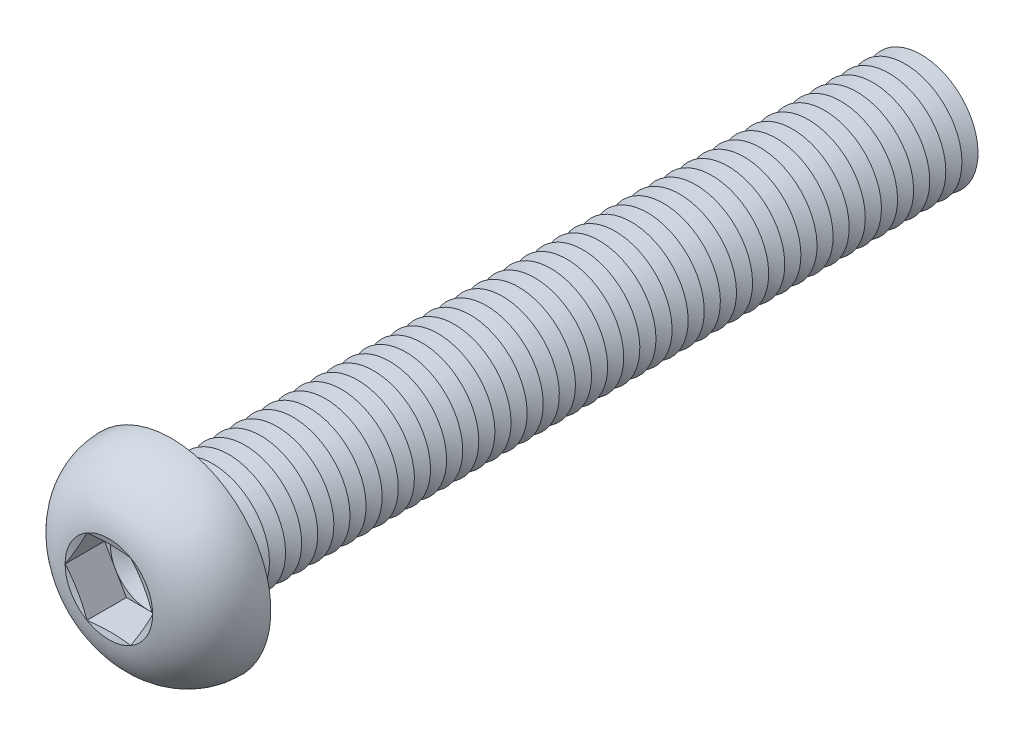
ISO-10303-21;
HEADER;
FILE_DESCRIPTION(('STEP AP214'),'2;1');
FILE_NAME('part.step','',(''),(''),'','','');
FILE_SCHEMA(('AUTOMOTIVE_DESIGN { 1 0 10303 214 1 1 1 1 }'));
ENDSEC;
DATA;
#1=APPLICATION_CONTEXT('core data for automotive mechanical design processes');
#2=APPLICATION_PROTOCOL_DEFINITION('international standard','automotive_design',2000,#1);
#3=PRODUCT_CONTEXT('',#1,'mechanical');
#4=PRODUCT('Part','Part','',(#3));
#5=PRODUCT_RELATED_PRODUCT_CATEGORY('part','',(#4));
#6=PRODUCT_DEFINITION_FORMATION('','',#4);
#7=PRODUCT_DEFINITION_CONTEXT('part definition',#1,'design');
#8=PRODUCT_DEFINITION('design','',#6,#7);
#9=PRODUCT_DEFINITION_SHAPE('','',#8);
#10=(LENGTH_UNIT() NAMED_UNIT(*) SI_UNIT(.MILLI.,.METRE.));
#11=(NAMED_UNIT(*) PLANE_ANGLE_UNIT() SI_UNIT($,.RADIAN.));
#12=(NAMED_UNIT(*) SI_UNIT($,.STERADIAN.) SOLID_ANGLE_UNIT());
#13=UNCERTAINTY_MEASURE_WITH_UNIT(LENGTH_MEASURE(1.E-05),#10,'distance_accuracy_value','');
#14=(GEOMETRIC_REPRESENTATION_CONTEXT(3) GLOBAL_UNCERTAINTY_ASSIGNED_CONTEXT((#13)) GLOBAL_UNIT_ASSIGNED_CONTEXT((#10,
#11,#12)) REPRESENTATION_CONTEXT('',''));
#15=CARTESIAN_POINT('',(0.,0.,0.));
#16=DIRECTION('',(0.,0.,1.));
#17=DIRECTION('',(1.,0.,0.));
#18=AXIS2_PLACEMENT_3D('',#15,#16,#17);
#19=CARTESIAN_POINT('',(0.,0.,2.43999999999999));
#20=DIRECTION('',(0.,0.,1.));
#21=DIRECTION('',(1.,0.,0.));
#22=AXIS2_PLACEMENT_3D('',#19,#20,#21);
#23=PLANE('',#22);
#24=CARTESIAN_POINT('',(0.,0.,2.43999999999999));
#25=DIRECTION('',(0.,0.,1.));
#26=DIRECTION('',(1.,0.,0.));
#27=AXIS2_PLACEMENT_3D('',#24,#25,#26);
#28=CIRCLE('',#27,3.99999813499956);
#29=CARTESIAN_POINT('',(3.4641,1.99999906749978,2.43999999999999));
#30=VERTEX_POINT('',#29);
#31=CARTESIAN_POINT('',(0.,3.99999813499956,2.43999999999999));
#32=VERTEX_POINT('',#31);
#33=EDGE_CURVE('E118',#30,#32,#28,.T.);
#34=ORIENTED_EDGE('',*,*,#33,.F.);
#35=DIRECTION('',(-0.5,0.866025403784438,0.));
#36=VECTOR('',#35,1.);
#37=CARTESIAN_POINT('',(4.6188,0.,2.43999999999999));
#38=LINE('',#37,#36);
#39=CARTESIAN_POINT('',(2.3094,3.99999813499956,2.43999999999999));
#40=VERTEX_POINT('',#39);
#41=EDGE_CURVE('E125',#30,#40,#38,.T.);
#42=ORIENTED_EDGE('',*,*,#41,.T.);
#43=DIRECTION('',(-1.,0.,0.));
#44=VECTOR('',#43,1.);
#45=CARTESIAN_POINT('',(2.3094,3.99999813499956,2.43999999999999));
#46=LINE('',#45,#44);
#47=EDGE_CURVE('E136',#40,#32,#46,.T.);
#48=ORIENTED_EDGE('',*,*,#47,.T.);
#49=EDGE_LOOP('',(#34,#42,#48));
#50=FACE_BOUND('',#49,.T.);
#51=ADVANCED_FACE('F39',(#50),#23,.T.);
#52=CARTESIAN_POINT('',(0.,0.,2.43999999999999));
#53=DIRECTION('',(0.,0.,1.));
#54=DIRECTION('',(1.,0.,0.));
#55=AXIS2_PLACEMENT_3D('',#52,#53,#54);
#56=CIRCLE('',#55,3.99999813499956);
#57=CARTESIAN_POINT('',(-3.4641,1.99999906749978,2.43999999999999));
#58=VERTEX_POINT('',#57);
#59=EDGE_CURVE('E11',#32,#58,#56,.T.);
#60=ORIENTED_EDGE('',*,*,#59,.F.);
#61=CARTESIAN_POINT('',(-2.3094,3.99999813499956,2.43999999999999));
#62=VERTEX_POINT('',#61);
#63=EDGE_CURVE('E131',#32,#62,#46,.T.);
#64=ORIENTED_EDGE('',*,*,#63,.T.);
#65=DIRECTION('',(-0.5,-0.866025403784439,0.));
#66=VECTOR('',#65,1.);
#67=CARTESIAN_POINT('',(-2.3094,3.99999813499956,2.43999999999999));
#68=LINE('',#67,#66);
#69=EDGE_CURVE('E134',#62,#58,#68,.T.);
#70=ORIENTED_EDGE('',*,*,#69,.T.);
#71=EDGE_LOOP('',(#60,#64,#70));
#72=FACE_BOUND('',#71,.T.);
#73=ADVANCED_FACE('F130',(#72),#23,.T.);
#74=CARTESIAN_POINT('',(-3.4641,-1.99999906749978,2.43999999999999));
#75=VERTEX_POINT('',#74);
#76=EDGE_CURVE('E49',#58,#75,#56,.T.);
#77=ORIENTED_EDGE('',*,*,#76,.F.);
#78=CARTESIAN_POINT('',(-4.6188,0.,2.43999999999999));
#79=VERTEX_POINT('',#78);
#80=EDGE_CURVE('E143',#58,#79,#68,.T.);
#81=ORIENTED_EDGE('',*,*,#80,.T.);
#82=DIRECTION('',(0.5,-0.866025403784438,0.));
#83=VECTOR('',#82,1.);
#84=CARTESIAN_POINT('',(-4.6188,0.,2.43999999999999));
#85=LINE('',#84,#83);
#86=EDGE_CURVE('E152',#79,#75,#85,.T.);
#87=ORIENTED_EDGE('',*,*,#86,.T.);
#88=EDGE_LOOP('',(#77,#81,#87));
#89=FACE_BOUND('',#88,.T.);
#90=ADVANCED_FACE('F647',(#89),#23,.T.);
#91=CARTESIAN_POINT('',(0.,-3.99999813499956,2.43999999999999));
#92=VERTEX_POINT('',#91);
#93=EDGE_CURVE('E632',#75,#92,#56,.T.);
#94=ORIENTED_EDGE('',*,*,#93,.F.);
#95=CARTESIAN_POINT('',(-2.3094,-3.99999813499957,2.43999999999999));
#96=VERTEX_POINT('',#95);
#97=EDGE_CURVE('E151',#75,#96,#85,.T.);
#98=ORIENTED_EDGE('',*,*,#97,.T.);
#99=DIRECTION('',(1.,0.,0.));
#100=VECTOR('',#99,1.);
#101=CARTESIAN_POINT('',(-2.3094,-3.99999813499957,2.43999999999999));
#102=LINE('',#101,#100);
#103=EDGE_CURVE('E157',#96,#92,#102,.T.);
#104=ORIENTED_EDGE('',*,*,#103,.T.);
#105=EDGE_LOOP('',(#94,#98,#104));
#106=FACE_BOUND('',#105,.T.);
#107=ADVANCED_FACE('F640',(#106),#23,.T.);
#108=CARTESIAN_POINT('',(3.4641,-1.99999906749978,2.43999999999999));
#109=VERTEX_POINT('',#108);
#110=EDGE_CURVE('E56',#92,#109,#56,.T.);
#111=ORIENTED_EDGE('',*,*,#110,.F.);
#112=CARTESIAN_POINT('',(2.3094,-3.99999813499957,2.43999999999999));
#113=VERTEX_POINT('',#112);
#114=EDGE_CURVE('E156',#92,#113,#102,.T.);
#115=ORIENTED_EDGE('',*,*,#114,.T.);
#116=DIRECTION('',(0.5,0.866025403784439,0.));
#117=VECTOR('',#116,1.);
#118=CARTESIAN_POINT('',(2.3094,-3.99999813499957,2.43999999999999));
#119=LINE('',#118,#117);
#120=EDGE_CURVE('E162',#113,#109,#119,.T.);
#121=ORIENTED_EDGE('',*,*,#120,.T.);
#122=EDGE_LOOP('',(#111,#115,#121));
#123=FACE_BOUND('',#122,.T.);
#124=ADVANCED_FACE('F717',(#123),#23,.T.);
#125=CARTESIAN_POINT('',(0.,0.,6.59999999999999));
#126=DIRECTION('',(0.,0.,1.));
#127=DIRECTION('',(0.,-1.,0.));
#128=AXIS2_PLACEMENT_3D('',#125,#126,#127);
#129=CONICAL_SURFACE('',#128,4.6188,1.30899693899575);
#130=CARTESIAN_POINT('',(4.61891547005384,-0.000200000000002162,6.6000309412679));
#131=CARTESIAN_POINT('',(4.52300232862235,0.165926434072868,6.57431944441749));
#132=CARTESIAN_POINT('',(4.42691527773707,0.332354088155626,6.55097758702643));
#133=CARTESIAN_POINT('',(4.23440181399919,0.665797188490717,6.50996805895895));
#134=CARTESIAN_POINT('',(4.13797527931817,0.832812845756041,6.49230269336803));
#135=CARTESIAN_POINT('',(3.94536752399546,1.16641926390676,6.46367750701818));
#136=CARTESIAN_POINT('',(3.84918760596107,1.33300776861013,6.45268354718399));
#137=CARTESIAN_POINT('',(3.65670510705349,1.66639723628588,6.4379417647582));
#138=CARTESIAN_POINT('',(3.56040255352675,1.83319815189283,6.43419253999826));
#139=CARTESIAN_POINT('',(3.36779744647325,2.16679998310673,6.43419253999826));
#140=CARTESIAN_POINT('',(3.2714948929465,2.33360089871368,6.4379417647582));
#141=CARTESIAN_POINT('',(3.07901239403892,2.66699036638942,6.45268354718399));
#142=CARTESIAN_POINT('',(2.98283247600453,2.8335788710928,6.46367750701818));
#143=CARTESIAN_POINT('',(2.79022472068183,3.16718528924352,6.49230269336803));
#144=CARTESIAN_POINT('',(2.69379818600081,3.33420094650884,6.50996805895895));
#145=CARTESIAN_POINT('',(2.50128472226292,3.66764404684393,6.55097758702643));
#146=CARTESIAN_POINT('',(2.40519767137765,3.83407170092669,6.57431944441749));
#147=CARTESIAN_POINT('',(2.30928452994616,4.00019813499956,6.6000309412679));
#148=B_SPLINE_CURVE_WITH_KNOTS('',3,(#130,#131,#132,#133,#134,#135,#136,#137,#138,#139,#140,
#141,#142,#143,#144,#145,#146,#147),.UNSPECIFIED.,.F.,.F.,(4,2,2,2,2,2,2,2,4),(0.,
0.580655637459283,1.16154676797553,1.73943971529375,2.31722080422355,2.89500189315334,
3.47289484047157,4.05378597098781,4.63444160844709),.UNSPECIFIED.);
#149=CARTESIAN_POINT('',(4.6188,0.,6.59999999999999));
#150=VERTEX_POINT('',#149);
#151=CARTESIAN_POINT('',(2.30940000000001,3.99999813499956,6.6));
#152=VERTEX_POINT('',#151);
#153=EDGE_CURVE('E222',#150,#152,#148,.T.);
#154=ORIENTED_EDGE('',*,*,#153,.F.);
#155=CARTESIAN_POINT('',(0.,0.,6.59999999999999));
#156=DIRECTION('',(0.,0.,-1.));
#157=DIRECTION('',(0.,1.,0.));
#158=AXIS2_PLACEMENT_3D('',#155,#156,#157);
#159=CIRCLE('',#158,4.6188);
#160=EDGE_CURVE('E613',#152,#150,#159,.T.);
#161=ORIENTED_EDGE('',*,*,#160,.F.);
#162=EDGE_LOOP('',(#154,#161));
#163=FACE_BOUND('',#162,.T.);
#164=ADVANCED_FACE('F721',(#163),#129,.F.);
#165=CARTESIAN_POINT('',(2.30928452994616,-4.00019813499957,6.6000309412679));
#166=CARTESIAN_POINT('',(2.40519767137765,-3.8340717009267,6.57431944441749));
#167=CARTESIAN_POINT('',(2.50128472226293,-3.66764404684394,6.55097758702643));
#168=CARTESIAN_POINT('',(2.69379818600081,-3.33420094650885,6.50996805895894));
#169=CARTESIAN_POINT('',(2.79022472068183,-3.16718528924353,6.49230269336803));
#170=CARTESIAN_POINT('',(2.98283247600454,-2.8335788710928,6.46367750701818));
#171=CARTESIAN_POINT('',(3.07901239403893,-2.66699036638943,6.45268354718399));
#172=CARTESIAN_POINT('',(3.2714948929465,-2.33360089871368,6.4379417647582));
#173=CARTESIAN_POINT('',(3.36779744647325,-2.16679998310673,6.43419253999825));
#174=CARTESIAN_POINT('',(3.56040255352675,-1.83319815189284,6.43419253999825));
#175=CARTESIAN_POINT('',(3.6567051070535,-1.66639723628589,6.4379417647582));
#176=CARTESIAN_POINT('',(3.84918760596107,-1.33300776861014,6.45268354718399));
#177=CARTESIAN_POINT('',(3.94536752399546,-1.16641926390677,6.46367750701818));
#178=CARTESIAN_POINT('',(4.13797527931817,-0.832812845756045,6.49230269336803));
#179=CARTESIAN_POINT('',(4.23440181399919,-0.665797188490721,6.50996805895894));
#180=CARTESIAN_POINT('',(4.42691527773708,-0.33235408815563,6.55097758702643));
#181=CARTESIAN_POINT('',(4.52300232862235,-0.165926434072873,6.57431944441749));
#182=CARTESIAN_POINT('',(4.61891547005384,0.000199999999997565,6.6000309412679));
#183=B_SPLINE_CURVE_WITH_KNOTS('',3,(#165,#166,#167,#168,#169,#170,#171,#172,#173,#174,#175,
#176,#177,#178,#179,#180,#181,#182),.UNSPECIFIED.,.F.,.F.,(4,2,2,2,2,2,2,2,4),(0.,
0.580655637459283,1.16154676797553,1.73943971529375,2.31722080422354,2.89500189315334,
3.47289484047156,4.05378597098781,4.63444160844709),.UNSPECIFIED.);
#184=CARTESIAN_POINT('',(2.3094,-3.99999813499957,6.59999999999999));
#185=VERTEX_POINT('',#184);
#186=EDGE_CURVE('E231',#185,#150,#183,.T.);
#187=ORIENTED_EDGE('',*,*,#186,.F.);
#188=EDGE_CURVE('E617',#150,#185,#159,.T.);
#189=ORIENTED_EDGE('',*,*,#188,.F.);
#190=EDGE_LOOP('',(#187,#189));
#191=FACE_BOUND('',#190,.T.);
#192=ADVANCED_FACE('F683',(#191),#129,.F.);
#193=CARTESIAN_POINT('',(-6.96966750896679,-3.99999813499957,7.51561854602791));
#194=CARTESIAN_POINT('',(-6.80094634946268,-3.99999813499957,7.4764117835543));
#195=CARTESIAN_POINT('',(-6.63214895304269,-3.99999813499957,7.43753277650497));
#196=CARTESIAN_POINT('',(-6.29436999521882,-3.99999813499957,7.36057075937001));
#197=CARTESIAN_POINT('',(-6.12538843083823,-3.99999813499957,7.32248776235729));
#198=CARTESIAN_POINT('',(-5.61806276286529,-3.99999813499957,7.20963087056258));
#199=CARTESIAN_POINT('',(-5.27940301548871,-3.99999813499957,7.1362643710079));
#200=CARTESIAN_POINT('',(-4.5977576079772,-3.99999813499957,6.99431141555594));
#201=CARTESIAN_POINT('',(-4.25476115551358,-3.99999813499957,6.92577621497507));
#202=CARTESIAN_POINT('',(-3.56716783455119,-3.99999813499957,6.79696563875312));
#203=CARTESIAN_POINT('',(-3.22257082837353,-3.99999813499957,6.73669098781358));
#204=CARTESIAN_POINT('',(-2.54069952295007,-3.99999813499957,6.63002020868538));
#205=CARTESIAN_POINT('',(-2.20347918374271,-3.99999813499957,6.58329286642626));
#206=CARTESIAN_POINT('',(-1.6962445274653,-3.99999813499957,6.52585827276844));
#207=CARTESIAN_POINT('',(-1.52694760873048,-3.99999813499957,6.50882377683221));
#208=CARTESIAN_POINT('',(-1.187938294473,-3.99999813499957,6.47963274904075));
#209=CARTESIAN_POINT('',(-1.01822592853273,-3.99999813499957,6.4674758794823));
#210=CARTESIAN_POINT('',(-0.679233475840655,-3.99999813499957,6.44863176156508));
#211=CARTESIAN_POINT('',(-0.509954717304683,-3.99999813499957,6.44192096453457));
#212=CARTESIAN_POINT('',(-0.171265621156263,-3.99999813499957,6.43422163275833));
#213=CARTESIAN_POINT('',(-0.00185528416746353,-3.99999813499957,6.43323307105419));
#214=CARTESIAN_POINT('',(0.336912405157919,-3.99999813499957,6.43703123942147));
#215=CARTESIAN_POINT('',(0.506269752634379,-3.99999813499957,6.44181839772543));
#216=CARTESIAN_POINT('',(0.844732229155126,-3.99999813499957,6.45691823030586));
#217=CARTESIAN_POINT('',(1.01383735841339,-3.99999813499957,6.46723089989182));
#218=CARTESIAN_POINT('',(1.42449950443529,-3.99999813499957,6.49843349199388));
#219=CARTESIAN_POINT('',(1.66585565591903,-3.99999813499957,6.52196685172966));
#220=CARTESIAN_POINT('',(2.14755410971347,-3.99999813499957,6.57749710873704));
#221=CARTESIAN_POINT('',(2.3878964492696,-3.99999813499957,6.60949369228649));
#222=CARTESIAN_POINT('',(2.86835569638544,-3.99999813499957,6.68017769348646));
#223=CARTESIAN_POINT('',(3.10846949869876,-3.99999813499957,6.71888590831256));
#224=CARTESIAN_POINT('',(3.5878341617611,-3.99999813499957,6.80132981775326));
#225=CARTESIAN_POINT('',(3.82708497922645,-3.99999813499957,6.84506576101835));
#226=CARTESIAN_POINT('',(4.30977392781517,-3.99999813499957,6.93726543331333));
#227=CARTESIAN_POINT('',(4.55319689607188,-3.99999813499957,6.98580793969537));
#228=CARTESIAN_POINT('',(5.03943022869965,-3.99999813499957,7.085866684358));
#229=CARTESIAN_POINT('',(5.28224058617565,-3.99999813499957,7.13738295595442));
#230=CARTESIAN_POINT('',(5.76604885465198,-3.99999813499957,7.24238429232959));
#231=CARTESIAN_POINT('',(6.00704943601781,-3.99999813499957,7.29585711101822));
#232=CARTESIAN_POINT('',(6.48863948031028,-3.99999813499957,7.40454827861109));
#233=CARTESIAN_POINT('',(6.72922897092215,-3.99999813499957,7.45976650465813));
#234=CARTESIAN_POINT('',(6.9696675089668,-3.99999813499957,7.51561854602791));
#235=B_SPLINE_CURVE_WITH_KNOTS('',3,(#193,#194,#195,#196,#197,#198,#199,#200,#201,#202,#203,
#204,#205,#206,#207,#208,#209,#210,#211,#212,#213,#214,#215,#216,#217,#218,#219,#220,#221,#222,
#223,#224,#225,#226,#227,#228,#229,#230,#231,#232,#233,#234),.UNSPECIFIED.,.F.,.F.,(4,2,2,2,2,2,
2,2,2,2,2,2,2,2,2,2,2,2,2,2,4),(0.,0.519649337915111,1.03930720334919,2.07882421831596,
3.1280857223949,4.17743921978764,5.19841727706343,5.7088142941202,6.21917596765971,
6.72731891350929,7.23545946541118,7.74363769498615,8.25181549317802,8.97911831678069,
9.70639418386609,10.4359652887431,11.1655724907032,11.910195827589,12.6548275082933,
13.395405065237,14.1359306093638),.UNSPECIFIED.);
#236=CARTESIAN_POINT('',(-2.3094,-3.99999813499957,6.59999999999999));
#237=VERTEX_POINT('',#236);
#238=EDGE_CURVE('E661',#237,#185,#235,.T.);
#239=ORIENTED_EDGE('',*,*,#238,.F.);
#240=EDGE_CURVE('E674',#185,#237,#159,.T.);
#241=ORIENTED_EDGE('',*,*,#240,.F.);
#242=EDGE_LOOP('',(#239,#241));
#243=FACE_BOUND('',#242,.T.);
#244=ADVANCED_FACE('F688',(#243),#129,.F.);
#245=CARTESIAN_POINT('',(-4.61891547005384,0.000199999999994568,6.6000309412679));
#246=CARTESIAN_POINT('',(-4.52300232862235,-0.165926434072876,6.57431944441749));
#247=CARTESIAN_POINT('',(-4.42691527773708,-0.332354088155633,6.55097758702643));
#248=CARTESIAN_POINT('',(-4.23440181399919,-0.665797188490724,6.50996805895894));
#249=CARTESIAN_POINT('',(-4.13797527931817,-0.832812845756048,6.49230269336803));
#250=CARTESIAN_POINT('',(-3.94536752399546,-1.16641926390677,6.46367750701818));
#251=CARTESIAN_POINT('',(-3.84918760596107,-1.33300776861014,6.45268354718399));
#252=CARTESIAN_POINT('',(-3.6567051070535,-1.66639723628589,6.4379417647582));
#253=CARTESIAN_POINT('',(-3.56040255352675,-1.83319815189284,6.43419253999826));
#254=CARTESIAN_POINT('',(-3.36779744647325,-2.16679998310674,6.43419253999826));
#255=CARTESIAN_POINT('',(-3.2714948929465,-2.33360089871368,6.4379417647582));
#256=CARTESIAN_POINT('',(-3.07901239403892,-2.66699036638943,6.45268354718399));
#257=CARTESIAN_POINT('',(-2.98283247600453,-2.83357887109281,6.46367750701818));
#258=CARTESIAN_POINT('',(-2.79022472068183,-3.16718528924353,6.49230269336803));
#259=CARTESIAN_POINT('',(-2.69379818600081,-3.33420094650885,6.50996805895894));
#260=CARTESIAN_POINT('',(-2.50128472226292,-3.66764404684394,6.55097758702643));
#261=CARTESIAN_POINT('',(-2.40519767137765,-3.8340717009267,6.57431944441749));
#262=CARTESIAN_POINT('',(-2.30928452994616,-4.00019813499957,6.60003094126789));
#263=B_SPLINE_CURVE_WITH_KNOTS('',3,(#245,#246,#247,#248,#249,#250,#251,#252,#253,#254,#255,
#256,#257,#258,#259,#260,#261,#262),.UNSPECIFIED.,.F.,.F.,(4,2,2,2,2,2,2,2,4),(0.,
0.580655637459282,1.16154676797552,1.73943971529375,2.31722080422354,2.89500189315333,
3.47289484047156,4.05378597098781,4.63444160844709),.UNSPECIFIED.);
#264=CARTESIAN_POINT('',(-4.6188,0.,6.59999999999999));
#265=VERTEX_POINT('',#264);
#266=EDGE_CURVE('E652',#265,#237,#263,.T.);
#267=ORIENTED_EDGE('',*,*,#266,.F.);
#268=EDGE_CURVE('E658',#237,#265,#159,.T.);
#269=ORIENTED_EDGE('',*,*,#268,.F.);
#270=EDGE_LOOP('',(#267,#269));
#271=FACE_BOUND('',#270,.T.);
#272=ADVANCED_FACE('F656',(#271),#129,.F.);
#273=CARTESIAN_POINT('',(-2.30928452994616,4.00019813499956,6.6000309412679));
#274=CARTESIAN_POINT('',(-2.40519767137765,3.83407170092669,6.57431944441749));
#275=CARTESIAN_POINT('',(-2.50128472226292,3.66764404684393,6.55097758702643));
#276=CARTESIAN_POINT('',(-2.69379818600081,3.33420094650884,6.50996805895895));
#277=CARTESIAN_POINT('',(-2.79022472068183,3.16718528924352,6.49230269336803));
#278=CARTESIAN_POINT('',(-2.98283247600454,2.8335788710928,6.46367750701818));
#279=CARTESIAN_POINT('',(-3.07901239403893,2.66699036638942,6.45268354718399));
#280=CARTESIAN_POINT('',(-3.2714948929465,2.33360089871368,6.4379417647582));
#281=CARTESIAN_POINT('',(-3.36779744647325,2.16679998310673,6.43419253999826));
#282=CARTESIAN_POINT('',(-3.56040255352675,1.83319815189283,6.43419253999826));
#283=CARTESIAN_POINT('',(-3.6567051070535,1.66639723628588,6.4379417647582));
#284=CARTESIAN_POINT('',(-3.84918760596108,1.33300776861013,6.45268354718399));
#285=CARTESIAN_POINT('',(-3.94536752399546,1.16641926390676,6.46367750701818));
#286=CARTESIAN_POINT('',(-4.13797527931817,0.832812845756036,6.49230269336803));
#287=CARTESIAN_POINT('',(-4.23440181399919,0.665797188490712,6.50996805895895));
#288=CARTESIAN_POINT('',(-4.42691527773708,0.332354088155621,6.55097758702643));
#289=CARTESIAN_POINT('',(-4.52300232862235,0.165926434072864,6.57431944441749));
#290=CARTESIAN_POINT('',(-4.61891547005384,-0.000200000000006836,6.6000309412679));
#291=B_SPLINE_CURVE_WITH_KNOTS('',3,(#273,#274,#275,#276,#277,#278,#279,#280,#281,#282,#283,
#284,#285,#286,#287,#288,#289,#290),.UNSPECIFIED.,.F.,.F.,(4,2,2,2,2,2,2,2,4),(0.,
0.580655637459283,1.16154676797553,1.73943971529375,2.31722080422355,2.89500189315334,
3.47289484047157,4.05378597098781,4.63444160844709),.UNSPECIFIED.);
#292=CARTESIAN_POINT('',(-2.3094,3.99999813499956,6.59999999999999));
#293=VERTEX_POINT('',#292);
#294=EDGE_CURVE('E195',#293,#265,#291,.T.);
#295=ORIENTED_EDGE('',*,*,#294,.F.);
#296=EDGE_CURVE('E664',#265,#293,#159,.T.);
#297=ORIENTED_EDGE('',*,*,#296,.F.);
#298=EDGE_LOOP('',(#295,#297));
#299=FACE_BOUND('',#298,.T.);
#300=ADVANCED_FACE('F665',(#299),#129,.F.);
#301=CARTESIAN_POINT('',(0.,0.,-74.05));
#302=DIRECTION('',(0.,0.,1.));
#303=DIRECTION('',(0.,-1.,0.));
#304=AXIS2_PLACEMENT_3D('',#301,#302,#303);
#305=CONICAL_SURFACE('',#304,5.99999999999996,1.04719755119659);
#306=CARTESIAN_POINT('',(0.,0.,-74.9));
#307=DIRECTION('',(0.,0.,1.));
#308=DIRECTION('',(0.,-1.,0.));
#309=AXIS2_PLACEMENT_3D('',#306,#307,#308);
#310=CIRCLE('',#309,4.52775681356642);
#311=CARTESIAN_POINT('',(0.,-4.52775681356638,-74.9));
#312=VERTEX_POINT('',#311);
#313=EDGE_CURVE('E584',#312,#312,#310,.T.);
#314=ORIENTED_EDGE('',*,*,#313,.T.);
#315=EDGE_LOOP('',(#314));
#316=FACE_BOUND('',#315,.T.);
#317=CARTESIAN_POINT('',(0.,0.,-74.05));
#318=DIRECTION('',(0.,0.,1.));
#319=DIRECTION('',(0.,-1.,0.));
#320=AXIS2_PLACEMENT_3D('',#317,#318,#319);
#321=CIRCLE('',#320,5.99999999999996);
#322=CARTESIAN_POINT('',(0.,-5.99999999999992,-74.05));
#323=VERTEX_POINT('',#322);
#324=EDGE_CURVE('E580',#323,#323,#321,.T.);
#325=ORIENTED_EDGE('',*,*,#324,.F.);
#326=EDGE_LOOP('',(#325));
#327=FACE_BOUND('',#326,.T.);
#328=ADVANCED_FACE('F750',(#316,#327),#305,.T.);
#329=CARTESIAN_POINT('',(0.,0.,-74.9));
#330=DIRECTION('',(0.,0.,-1.));
#331=DIRECTION('',(0.,1.,0.));
#332=AXIS2_PLACEMENT_3D('',#329,#330,#331);
#333=CONICAL_SURFACE('',#332,4.52775681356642,1.0471975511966);
#334=CARTESIAN_POINT('',(0.,0.,-75.75));
#335=DIRECTION('',(0.,0.,1.));
#336=DIRECTION('',(0.,-1.,0.));
#337=AXIS2_PLACEMENT_3D('',#334,#335,#336);
#338=CIRCLE('',#337,5.99999999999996);
#339=CARTESIAN_POINT('',(0.,-5.99999999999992,-75.75));
#340=VERTEX_POINT('',#339);
#341=EDGE_CURVE('E588',#340,#340,#338,.T.);
#342=ORIENTED_EDGE('',*,*,#341,.T.);
#343=EDGE_LOOP('',(#342));
#344=FACE_BOUND('',#343,.T.);
#345=ORIENTED_EDGE('',*,*,#313,.F.);
#346=EDGE_LOOP('',(#345));
#347=FACE_BOUND('',#346,.T.);
#348=ADVANCED_FACE('F755',(#344,#347),#333,.T.);
#349=CARTESIAN_POINT('',(0.,5.99999999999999,-80.));
#350=DIRECTION('',(0.,0.,-1.));
#351=DIRECTION('',(0.,1.,0.));
#352=AXIS2_PLACEMENT_3D('',#349,#350,#351);
#353=PLANE('',#352);
#354=CARTESIAN_POINT('',(0.,0.,-80.));
#355=DIRECTION('',(0.,0.,1.));
#356=DIRECTION('',(0.,-1.,0.));
#357=AXIS2_PLACEMENT_3D('',#354,#355,#356);
#358=CIRCLE('',#357,4.52775681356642);
#359=CARTESIAN_POINT('',(0.,-4.52775681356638,-80.));
#360=VERTEX_POINT('',#359);
#361=EDGE_CURVE('E608',#360,#360,#358,.T.);
#362=ORIENTED_EDGE('',*,*,#361,.F.);
#363=EDGE_LOOP('',(#362));
#364=FACE_BOUND('',#363,.T.);
#365=ADVANCED_FACE('F930',(#364),#353,.T.);
#366=CARTESIAN_POINT('',(0.,0.,-79.15));
#367=DIRECTION('',(0.,0.,1.));
#368=DIRECTION('',(0.,-1.,0.));
#369=AXIS2_PLACEMENT_3D('',#366,#367,#368);
#370=CONICAL_SURFACE('',#369,5.99999999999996,1.04719755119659);
#371=ORIENTED_EDGE('',*,*,#361,.T.);
#372=EDGE_LOOP('',(#371));
#373=FACE_BOUND('',#372,.T.);
#374=CARTESIAN_POINT('',(0.,0.,-79.15));
#375=DIRECTION('',(0.,0.,1.));
#376=DIRECTION('',(0.,-1.,0.));
#377=AXIS2_PLACEMENT_3D('',#374,#375,#376);
#378=CIRCLE('',#377,5.99999999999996);
#379=CARTESIAN_POINT('',(0.,-5.99999999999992,-79.15));
#380=VERTEX_POINT('',#379);
#381=EDGE_CURVE('E604',#380,#380,#378,.T.);
#382=ORIENTED_EDGE('',*,*,#381,.F.);
#383=EDGE_LOOP('',(#382));
#384=FACE_BOUND('',#383,.T.);
#385=ADVANCED_FACE('F923',(#373,#384),#370,.T.);
#386=CARTESIAN_POINT('',(0.,0.,-78.3));
#387=DIRECTION('',(0.,0.,-1.));
#388=DIRECTION('',(0.,1.,0.));
#389=AXIS2_PLACEMENT_3D('',#386,#387,#388);
#390=CONICAL_SURFACE('',#389,4.52775681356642,1.0471975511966);
#391=ORIENTED_EDGE('',*,*,#381,.T.);
#392=EDGE_LOOP('',(#391));
#393=FACE_BOUND('',#392,.T.);
#394=CARTESIAN_POINT('',(0.,0.,-78.3));
#395=DIRECTION('',(0.,0.,1.));
#396=DIRECTION('',(0.,-1.,0.));
#397=AXIS2_PLACEMENT_3D('',#394,#395,#396);
#398=CIRCLE('',#397,4.52775681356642);
#399=CARTESIAN_POINT('',(0.,-4.52775681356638,-78.3));
#400=VERTEX_POINT('',#399);
#401=EDGE_CURVE('E600',#400,#400,#398,.T.);
#402=ORIENTED_EDGE('',*,*,#401,.F.);
#403=EDGE_LOOP('',(#402));
#404=FACE_BOUND('',#403,.T.);
#405=ADVANCED_FACE('F929',(#393,#404),#390,.T.);
#406=CARTESIAN_POINT('',(0.,0.,-77.45));
#407=DIRECTION('',(0.,0.,1.));
#408=DIRECTION('',(0.,-1.,0.));
#409=AXIS2_PLACEMENT_3D('',#406,#407,#408);
#410=CONICAL_SURFACE('',#409,5.99999999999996,1.04719755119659);
#411=ORIENTED_EDGE('',*,*,#401,.T.);
#412=EDGE_LOOP('',(#411));
#413=FACE_BOUND('',#412,.T.);
#414=CARTESIAN_POINT('',(0.,0.,-77.4499999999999));
#415=DIRECTION('',(0.,0.,1.));
#416=DIRECTION('',(0.,-1.,0.));
#417=AXIS2_PLACEMENT_3D('',#414,#415,#416);
#418=CIRCLE('',#417,5.99999999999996);
#419=CARTESIAN_POINT('',(0.,-5.99999999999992,-77.4499999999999));
#420=VERTEX_POINT('',#419);
#421=EDGE_CURVE('E596',#420,#420,#418,.T.);
#422=ORIENTED_EDGE('',*,*,#421,.F.);
#423=EDGE_LOOP('',(#422));
#424=FACE_BOUND('',#423,.T.);
#425=ADVANCED_FACE('F961',(#413,#424),#410,.T.);
#426=CARTESIAN_POINT('',(0.,0.,-76.6));
#427=DIRECTION('',(0.,0.,-1.));
#428=DIRECTION('',(0.,1.,0.));
#429=AXIS2_PLACEMENT_3D('',#426,#427,#428);
#430=CONICAL_SURFACE('',#429,4.52775681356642,1.0471975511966);
#431=ORIENTED_EDGE('',*,*,#421,.T.);
#432=EDGE_LOOP('',(#431));
#433=FACE_BOUND('',#432,.T.);
#434=CARTESIAN_POINT('',(0.,0.,-76.6));
#435=DIRECTION('',(0.,0.,1.));
#436=DIRECTION('',(0.,-1.,0.));
#437=AXIS2_PLACEMENT_3D('',#434,#435,#436);
#438=CIRCLE('',#437,4.52775681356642);
#439=CARTESIAN_POINT('',(0.,-4.52775681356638,-76.6));
#440=VERTEX_POINT('',#439);
#441=EDGE_CURVE('E592',#440,#440,#438,.T.);
#442=ORIENTED_EDGE('',*,*,#441,.F.);
#443=EDGE_LOOP('',(#442));
#444=FACE_BOUND('',#443,.T.);
#445=ADVANCED_FACE('F971',(#433,#444),#430,.T.);
#446=CARTESIAN_POINT('',(0.,0.,-75.75));
#447=DIRECTION('',(0.,0.,1.));
#448=DIRECTION('',(0.,-1.,0.));
#449=AXIS2_PLACEMENT_3D('',#446,#447,#448);
#450=CONICAL_SURFACE('',#449,5.99999999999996,1.04719755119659);
#451=ORIENTED_EDGE('',*,*,#441,.T.);
#452=EDGE_LOOP('',(#451));
#453=FACE_BOUND('',#452,.T.);
#454=ORIENTED_EDGE('',*,*,#341,.F.);
#455=EDGE_LOOP('',(#454));
#456=FACE_BOUND('',#455,.T.);
#457=ADVANCED_FACE('F981',(#453,#456),#450,.T.);
#458=CARTESIAN_POINT('',(0.,0.,-72.35));
#459=DIRECTION('',(0.,0.,1.));
#460=DIRECTION('',(0.,-1.,0.));
#461=AXIS2_PLACEMENT_3D('',#458,#459,#460);
#462=CONICAL_SURFACE('',#461,5.99999999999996,1.04719755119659);
#463=CARTESIAN_POINT('',(0.,0.,-73.2));
#464=DIRECTION('',(0.,0.,1.));
#465=DIRECTION('',(0.,-1.,0.));
#466=AXIS2_PLACEMENT_3D('',#463,#464,#465);
#467=CIRCLE('',#466,4.52775681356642);
#468=CARTESIAN_POINT('',(0.,-4.52775681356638,-73.2));
#469=VERTEX_POINT('',#468);
#470=EDGE_CURVE('E576',#469,#469,#467,.T.);
#471=ORIENTED_EDGE('',*,*,#470,.T.);
#472=EDGE_LOOP('',(#471));
#473=FACE_BOUND('',#472,.T.);
#474=CARTESIAN_POINT('',(0.,0.,-72.35));
#475=DIRECTION('',(0.,0.,1.));
#476=DIRECTION('',(0.,-1.,0.));
#477=AXIS2_PLACEMENT_3D('',#474,#475,#476);
#478=CIRCLE('',#477,5.99999999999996);
#479=CARTESIAN_POINT('',(0.,-5.99999999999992,-72.35));
#480=VERTEX_POINT('',#479);
#481=EDGE_CURVE('E572',#480,#480,#478,.T.);
#482=ORIENTED_EDGE('',*,*,#481,.F.);
#483=EDGE_LOOP('',(#482));
#484=FACE_BOUND('',#483,.T.);
#485=ADVANCED_FACE('F991',(#473,#484),#462,.T.);
#486=CARTESIAN_POINT('',(0.,0.,-73.2));
#487=DIRECTION('',(0.,0.,-1.));
#488=DIRECTION('',(0.,1.,0.));
#489=AXIS2_PLACEMENT_3D('',#486,#487,#488);
#490=CONICAL_SURFACE('',#489,4.52775681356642,1.0471975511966);
#491=ORIENTED_EDGE('',*,*,#324,.T.);
#492=EDGE_LOOP('',(#491));
#493=FACE_BOUND('',#492,.T.);
#494=ORIENTED_EDGE('',*,*,#470,.F.);
#495=EDGE_LOOP('',(#494));
#496=FACE_BOUND('',#495,.T.);
#497=ADVANCED_FACE('F1001',(#493,#496),#490,.T.);
#498=CARTESIAN_POINT('',(0.,0.,-70.65));
#499=DIRECTION('',(0.,0.,1.));
#500=DIRECTION('',(0.,-1.,0.));
#501=AXIS2_PLACEMENT_3D('',#498,#499,#500);
#502=CONICAL_SURFACE('',#501,5.99999999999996,1.04719755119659);
#503=CARTESIAN_POINT('',(0.,0.,-71.5));
#504=DIRECTION('',(0.,0.,1.));
#505=DIRECTION('',(0.,-1.,0.));
#506=AXIS2_PLACEMENT_3D('',#503,#504,#505);
#507=CIRCLE('',#506,4.52775681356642);
#508=CARTESIAN_POINT('',(0.,-4.52775681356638,-71.5));
#509=VERTEX_POINT('',#508);
#510=EDGE_CURVE('E568',#509,#509,#507,.T.);
#511=ORIENTED_EDGE('',*,*,#510,.T.);
#512=EDGE_LOOP('',(#511));
#513=FACE_BOUND('',#512,.T.);
#514=CARTESIAN_POINT('',(0.,0.,-70.6499999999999));
#515=DIRECTION('',(0.,0.,1.));
#516=DIRECTION('',(0.,-1.,0.));
#517=AXIS2_PLACEMENT_3D('',#514,#515,#516);
#518=CIRCLE('',#517,5.99999999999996);
#519=CARTESIAN_POINT('',(0.,-5.99999999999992,-70.6499999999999));
#520=VERTEX_POINT('',#519);
#521=EDGE_CURVE('E564',#520,#520,#518,.T.);
#522=ORIENTED_EDGE('',*,*,#521,.F.);
#523=EDGE_LOOP('',(#522));
#524=FACE_BOUND('',#523,.T.);
#525=ADVANCED_FACE('F1011',(#513,#524),#502,.T.);
#526=CARTESIAN_POINT('',(0.,0.,-71.5));
#527=DIRECTION('',(0.,0.,-1.));
#528=DIRECTION('',(0.,1.,0.));
#529=AXIS2_PLACEMENT_3D('',#526,#527,#528);
#530=CONICAL_SURFACE('',#529,4.52775681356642,1.0471975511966);
#531=ORIENTED_EDGE('',*,*,#481,.T.);
#532=EDGE_LOOP('',(#531));
#533=FACE_BOUND('',#532,.T.);
#534=ORIENTED_EDGE('',*,*,#510,.F.);
#535=EDGE_LOOP('',(#534));
#536=FACE_BOUND('',#535,.T.);
#537=ADVANCED_FACE('F1021',(#533,#536),#530,.T.);
#538=CARTESIAN_POINT('',(0.,0.,-68.95));
#539=DIRECTION('',(0.,0.,1.));
#540=DIRECTION('',(0.,-1.,0.));
#541=AXIS2_PLACEMENT_3D('',#538,#539,#540);
#542=CONICAL_SURFACE('',#541,5.99999999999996,1.04719755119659);
#543=CARTESIAN_POINT('',(0.,0.,-69.8));
#544=DIRECTION('',(0.,0.,1.));
#545=DIRECTION('',(0.,-1.,0.));
#546=AXIS2_PLACEMENT_3D('',#543,#544,#545);
#547=CIRCLE('',#546,4.52775681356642);
#548=CARTESIAN_POINT('',(0.,-4.52775681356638,-69.8));
#549=VERTEX_POINT('',#548);
#550=EDGE_CURVE('E560',#549,#549,#547,.T.);
#551=ORIENTED_EDGE('',*,*,#550,.T.);
#552=EDGE_LOOP('',(#551));
#553=FACE_BOUND('',#552,.T.);
#554=CARTESIAN_POINT('',(0.,0.,-68.95));
#555=DIRECTION('',(0.,0.,1.));
#556=DIRECTION('',(0.,-1.,0.));
#557=AXIS2_PLACEMENT_3D('',#554,#555,#556);
#558=CIRCLE('',#557,5.99999999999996);
#559=CARTESIAN_POINT('',(0.,-5.99999999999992,-68.95));
#560=VERTEX_POINT('',#559);
#561=EDGE_CURVE('E556',#560,#560,#558,.T.);
#562=ORIENTED_EDGE('',*,*,#561,.F.);
#563=EDGE_LOOP('',(#562));
#564=FACE_BOUND('',#563,.T.);
#565=ADVANCED_FACE('F1031',(#553,#564),#542,.T.);
#566=CARTESIAN_POINT('',(0.,0.,-69.8));
#567=DIRECTION('',(0.,0.,-1.));
#568=DIRECTION('',(0.,1.,0.));
#569=AXIS2_PLACEMENT_3D('',#566,#567,#568);
#570=CONICAL_SURFACE('',#569,4.52775681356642,1.0471975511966);
#571=ORIENTED_EDGE('',*,*,#521,.T.);
#572=EDGE_LOOP('',(#571));
#573=FACE_BOUND('',#572,.T.);
#574=ORIENTED_EDGE('',*,*,#550,.F.);
#575=EDGE_LOOP('',(#574));
#576=FACE_BOUND('',#575,.T.);
#577=ADVANCED_FACE('F1041',(#573,#576),#570,.T.);
#578=CARTESIAN_POINT('',(0.,0.,-67.25));
#579=DIRECTION('',(0.,0.,1.));
#580=DIRECTION('',(0.,-1.,0.));
#581=AXIS2_PLACEMENT_3D('',#578,#579,#580);
#582=CONICAL_SURFACE('',#581,5.99999999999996,1.04719755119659);
#583=CARTESIAN_POINT('',(0.,0.,-68.1));
#584=DIRECTION('',(0.,0.,1.));
#585=DIRECTION('',(0.,-1.,0.));
#586=AXIS2_PLACEMENT_3D('',#583,#584,#585);
#587=CIRCLE('',#586,4.52775681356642);
#588=CARTESIAN_POINT('',(0.,-4.52775681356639,-68.1));
#589=VERTEX_POINT('',#588);
#590=EDGE_CURVE('E552',#589,#589,#587,.T.);
#591=ORIENTED_EDGE('',*,*,#590,.T.);
#592=EDGE_LOOP('',(#591));
#593=FACE_BOUND('',#592,.T.);
#594=CARTESIAN_POINT('',(0.,0.,-67.2499999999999));
#595=DIRECTION('',(0.,0.,1.));
#596=DIRECTION('',(0.,-1.,0.));
#597=AXIS2_PLACEMENT_3D('',#594,#595,#596);
#598=CIRCLE('',#597,5.99999999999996);
#599=CARTESIAN_POINT('',(0.,-5.99999999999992,-67.2499999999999));
#600=VERTEX_POINT('',#599);
#601=EDGE_CURVE('E548',#600,#600,#598,.T.);
#602=ORIENTED_EDGE('',*,*,#601,.F.);
#603=EDGE_LOOP('',(#602));
#604=FACE_BOUND('',#603,.T.);
#605=ADVANCED_FACE('F1051',(#593,#604),#582,.T.);
#606=CARTESIAN_POINT('',(0.,0.,-68.1));
#607=DIRECTION('',(0.,0.,-1.));
#608=DIRECTION('',(0.,1.,0.));
#609=AXIS2_PLACEMENT_3D('',#606,#607,#608);
#610=CONICAL_SURFACE('',#609,4.52775681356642,1.0471975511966);
#611=ORIENTED_EDGE('',*,*,#561,.T.);
#612=EDGE_LOOP('',(#611));
#613=FACE_BOUND('',#612,.T.);
#614=ORIENTED_EDGE('',*,*,#590,.F.);
#615=EDGE_LOOP('',(#614));
#616=FACE_BOUND('',#615,.T.);
#617=ADVANCED_FACE('F1061',(#613,#616),#610,.T.);
#618=CARTESIAN_POINT('',(0.,0.,-65.55));
#619=DIRECTION('',(0.,0.,1.));
#620=DIRECTION('',(0.,-1.,0.));
#621=AXIS2_PLACEMENT_3D('',#618,#619,#620);
#622=CONICAL_SURFACE('',#621,5.99999999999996,1.04719755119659);
#623=CARTESIAN_POINT('',(0.,0.,-66.4));
#624=DIRECTION('',(0.,0.,1.));
#625=DIRECTION('',(0.,-1.,0.));
#626=AXIS2_PLACEMENT_3D('',#623,#624,#625);
#627=CIRCLE('',#626,4.52775681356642);
#628=CARTESIAN_POINT('',(0.,-4.52775681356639,-66.4));
#629=VERTEX_POINT('',#628);
#630=EDGE_CURVE('E544',#629,#629,#627,.T.);
#631=ORIENTED_EDGE('',*,*,#630,.T.);
#632=EDGE_LOOP('',(#631));
#633=FACE_BOUND('',#632,.T.);
#634=CARTESIAN_POINT('',(0.,0.,-65.55));
#635=DIRECTION('',(0.,0.,1.));
#636=DIRECTION('',(0.,-1.,0.));
#637=AXIS2_PLACEMENT_3D('',#634,#635,#636);
#638=CIRCLE('',#637,5.99999999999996);
#639=CARTESIAN_POINT('',(0.,-5.99999999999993,-65.55));
#640=VERTEX_POINT('',#639);
#641=EDGE_CURVE('E540',#640,#640,#638,.T.);
#642=ORIENTED_EDGE('',*,*,#641,.F.);
#643=EDGE_LOOP('',(#642));
#644=FACE_BOUND('',#643,.T.);
#645=ADVANCED_FACE('F1071',(#633,#644),#622,.T.);
#646=CARTESIAN_POINT('',(0.,0.,-66.4));
#647=DIRECTION('',(0.,0.,-1.));
#648=DIRECTION('',(0.,1.,0.));
#649=AXIS2_PLACEMENT_3D('',#646,#647,#648);
#650=CONICAL_SURFACE('',#649,4.52775681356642,1.0471975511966);
#651=ORIENTED_EDGE('',*,*,#601,.T.);
#652=EDGE_LOOP('',(#651));
#653=FACE_BOUND('',#652,.T.);
#654=ORIENTED_EDGE('',*,*,#630,.F.);
#655=EDGE_LOOP('',(#654));
#656=FACE_BOUND('',#655,.T.);
#657=ADVANCED_FACE('F1081',(#653,#656),#650,.T.);
#658=CARTESIAN_POINT('',(0.,0.,-63.85));
#659=DIRECTION('',(0.,0.,1.));
#660=DIRECTION('',(0.,-1.,0.));
#661=AXIS2_PLACEMENT_3D('',#658,#659,#660);
#662=CONICAL_SURFACE('',#661,5.99999999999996,1.04719755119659);
#663=CARTESIAN_POINT('',(0.,0.,-64.7));
#664=DIRECTION('',(0.,0.,1.));
#665=DIRECTION('',(0.,-1.,0.));
#666=AXIS2_PLACEMENT_3D('',#663,#664,#665);
#667=CIRCLE('',#666,4.52775681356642);
#668=CARTESIAN_POINT('',(0.,-4.52775681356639,-64.7));
#669=VERTEX_POINT('',#668);
#670=EDGE_CURVE('E536',#669,#669,#667,.T.);
#671=ORIENTED_EDGE('',*,*,#670,.T.);
#672=EDGE_LOOP('',(#671));
#673=FACE_BOUND('',#672,.T.);
#674=CARTESIAN_POINT('',(0.,0.,-63.85));
#675=DIRECTION('',(0.,0.,1.));
#676=DIRECTION('',(0.,-1.,0.));
#677=AXIS2_PLACEMENT_3D('',#674,#675,#676);
#678=CIRCLE('',#677,5.99999999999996);
#679=CARTESIAN_POINT('',(0.,-5.99999999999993,-63.85));
#680=VERTEX_POINT('',#679);
#681=EDGE_CURVE('E532',#680,#680,#678,.T.);
#682=ORIENTED_EDGE('',*,*,#681,.F.);
#683=EDGE_LOOP('',(#682));
#684=FACE_BOUND('',#683,.T.);
#685=ADVANCED_FACE('F1091',(#673,#684),#662,.T.);
#686=CARTESIAN_POINT('',(0.,0.,-64.7));
#687=DIRECTION('',(0.,0.,-1.));
#688=DIRECTION('',(0.,1.,0.));
#689=AXIS2_PLACEMENT_3D('',#686,#687,#688);
#690=CONICAL_SURFACE('',#689,4.52775681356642,1.0471975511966);
#691=ORIENTED_EDGE('',*,*,#641,.T.);
#692=EDGE_LOOP('',(#691));
#693=FACE_BOUND('',#692,.T.);
#694=ORIENTED_EDGE('',*,*,#670,.F.);
#695=EDGE_LOOP('',(#694));
#696=FACE_BOUND('',#695,.T.);
#697=ADVANCED_FACE('F1101',(#693,#696),#690,.T.);
#698=CARTESIAN_POINT('',(0.,0.,-62.15));
#699=DIRECTION('',(0.,0.,1.));
#700=DIRECTION('',(0.,-1.,0.));
#701=AXIS2_PLACEMENT_3D('',#698,#699,#700);
#702=CONICAL_SURFACE('',#701,5.99999999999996,1.04719755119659);
#703=CARTESIAN_POINT('',(0.,0.,-63.));
#704=DIRECTION('',(0.,0.,1.));
#705=DIRECTION('',(0.,-1.,0.));
#706=AXIS2_PLACEMENT_3D('',#703,#704,#705);
#707=CIRCLE('',#706,4.52775681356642);
#708=CARTESIAN_POINT('',(0.,-4.52775681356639,-63.));
#709=VERTEX_POINT('',#708);
#710=EDGE_CURVE('E528',#709,#709,#707,.T.);
#711=ORIENTED_EDGE('',*,*,#710,.T.);
#712=EDGE_LOOP('',(#711));
#713=FACE_BOUND('',#712,.T.);
#714=CARTESIAN_POINT('',(0.,0.,-62.15));
#715=DIRECTION('',(0.,0.,1.));
#716=DIRECTION('',(0.,-1.,0.));
#717=AXIS2_PLACEMENT_3D('',#714,#715,#716);
#718=CIRCLE('',#717,5.99999999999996);
#719=CARTESIAN_POINT('',(0.,-5.99999999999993,-62.15));
#720=VERTEX_POINT('',#719);
#721=EDGE_CURVE('E524',#720,#720,#718,.T.);
#722=ORIENTED_EDGE('',*,*,#721,.F.);
#723=EDGE_LOOP('',(#722));
#724=FACE_BOUND('',#723,.T.);
#725=ADVANCED_FACE('F1111',(#713,#724),#702,.T.);
#726=CARTESIAN_POINT('',(0.,0.,-63.));
#727=DIRECTION('',(0.,0.,-1.));
#728=DIRECTION('',(0.,1.,0.));
#729=AXIS2_PLACEMENT_3D('',#726,#727,#728);
#730=CONICAL_SURFACE('',#729,4.52775681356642,1.0471975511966);
#731=ORIENTED_EDGE('',*,*,#681,.T.);
#732=EDGE_LOOP('',(#731));
#733=FACE_BOUND('',#732,.T.);
#734=ORIENTED_EDGE('',*,*,#710,.F.);
#735=EDGE_LOOP('',(#734));
#736=FACE_BOUND('',#735,.T.);
#737=ADVANCED_FACE('F1121',(#733,#736),#730,.T.);
#738=CARTESIAN_POINT('',(0.,0.,-60.45));
#739=DIRECTION('',(0.,0.,1.));
#740=DIRECTION('',(0.,-1.,0.));
#741=AXIS2_PLACEMENT_3D('',#738,#739,#740);
#742=CONICAL_SURFACE('',#741,5.99999999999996,1.04719755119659);
#743=CARTESIAN_POINT('',(0.,0.,-61.3));
#744=DIRECTION('',(0.,0.,1.));
#745=DIRECTION('',(0.,-1.,0.));
#746=AXIS2_PLACEMENT_3D('',#743,#744,#745);
#747=CIRCLE('',#746,4.52775681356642);
#748=CARTESIAN_POINT('',(0.,-4.52775681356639,-61.3));
#749=VERTEX_POINT('',#748);
#750=EDGE_CURVE('E520',#749,#749,#747,.T.);
#751=ORIENTED_EDGE('',*,*,#750,.T.);
#752=EDGE_LOOP('',(#751));
#753=FACE_BOUND('',#752,.T.);
#754=CARTESIAN_POINT('',(0.,0.,-60.4499999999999));
#755=DIRECTION('',(0.,0.,1.));
#756=DIRECTION('',(0.,-1.,0.));
#757=AXIS2_PLACEMENT_3D('',#754,#755,#756);
#758=CIRCLE('',#757,5.99999999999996);
#759=CARTESIAN_POINT('',(0.,-5.99999999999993,-60.4499999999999));
#760=VERTEX_POINT('',#759);
#761=EDGE_CURVE('E516',#760,#760,#758,.T.);
#762=ORIENTED_EDGE('',*,*,#761,.F.);
#763=EDGE_LOOP('',(#762));
#764=FACE_BOUND('',#763,.T.);
#765=ADVANCED_FACE('F1131',(#753,#764),#742,.T.);
#766=CARTESIAN_POINT('',(0.,0.,-61.3));
#767=DIRECTION('',(0.,0.,-1.));
#768=DIRECTION('',(0.,1.,0.));
#769=AXIS2_PLACEMENT_3D('',#766,#767,#768);
#770=CONICAL_SURFACE('',#769,4.52775681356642,1.0471975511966);
#771=ORIENTED_EDGE('',*,*,#721,.T.);
#772=EDGE_LOOP('',(#771));
#773=FACE_BOUND('',#772,.T.);
#774=ORIENTED_EDGE('',*,*,#750,.F.);
#775=EDGE_LOOP('',(#774));
#776=FACE_BOUND('',#775,.T.);
#777=ADVANCED_FACE('F1141',(#773,#776),#770,.T.);
#778=CARTESIAN_POINT('',(0.,0.,-58.75));
#779=DIRECTION('',(0.,0.,1.));
#780=DIRECTION('',(0.,-1.,0.));
#781=AXIS2_PLACEMENT_3D('',#778,#779,#780);
#782=CONICAL_SURFACE('',#781,5.99999999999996,1.04719755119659);
#783=CARTESIAN_POINT('',(0.,0.,-59.6));
#784=DIRECTION('',(0.,0.,1.));
#785=DIRECTION('',(0.,-1.,0.));
#786=AXIS2_PLACEMENT_3D('',#783,#784,#785);
#787=CIRCLE('',#786,4.52775681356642);
#788=CARTESIAN_POINT('',(0.,-4.52775681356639,-59.6));
#789=VERTEX_POINT('',#788);
#790=EDGE_CURVE('E512',#789,#789,#787,.T.);
#791=ORIENTED_EDGE('',*,*,#790,.T.);
#792=EDGE_LOOP('',(#791));
#793=FACE_BOUND('',#792,.T.);
#794=CARTESIAN_POINT('',(0.,0.,-58.75));
#795=DIRECTION('',(0.,0.,1.));
#796=DIRECTION('',(0.,-1.,0.));
#797=AXIS2_PLACEMENT_3D('',#794,#795,#796);
#798=CIRCLE('',#797,5.99999999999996);
#799=CARTESIAN_POINT('',(0.,-5.99999999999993,-58.75));
#800=VERTEX_POINT('',#799);
#801=EDGE_CURVE('E508',#800,#800,#798,.T.);
#802=ORIENTED_EDGE('',*,*,#801,.F.);
#803=EDGE_LOOP('',(#802));
#804=FACE_BOUND('',#803,.T.);
#805=ADVANCED_FACE('F1151',(#793,#804),#782,.T.);
#806=CARTESIAN_POINT('',(0.,0.,-59.6));
#807=DIRECTION('',(0.,0.,-1.));
#808=DIRECTION('',(0.,1.,0.));
#809=AXIS2_PLACEMENT_3D('',#806,#807,#808);
#810=CONICAL_SURFACE('',#809,4.52775681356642,1.0471975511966);
#811=ORIENTED_EDGE('',*,*,#761,.T.);
#812=EDGE_LOOP('',(#811));
#813=FACE_BOUND('',#812,.T.);
#814=ORIENTED_EDGE('',*,*,#790,.F.);
#815=EDGE_LOOP('',(#814));
#816=FACE_BOUND('',#815,.T.);
#817=ADVANCED_FACE('F1161',(#813,#816),#810,.T.);
#818=CARTESIAN_POINT('',(0.,0.,-57.05));
#819=DIRECTION('',(0.,0.,1.));
#820=DIRECTION('',(0.,-1.,0.));
#821=AXIS2_PLACEMENT_3D('',#818,#819,#820);
#822=CONICAL_SURFACE('',#821,5.99999999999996,1.04719755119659);
#823=CARTESIAN_POINT('',(0.,0.,-57.9));
#824=DIRECTION('',(0.,0.,1.));
#825=DIRECTION('',(0.,-1.,0.));
#826=AXIS2_PLACEMENT_3D('',#823,#824,#825);
#827=CIRCLE('',#826,4.52775681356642);
#828=CARTESIAN_POINT('',(0.,-4.52775681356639,-57.9));
#829=VERTEX_POINT('',#828);
#830=EDGE_CURVE('E504',#829,#829,#827,.T.);
#831=ORIENTED_EDGE('',*,*,#830,.T.);
#832=EDGE_LOOP('',(#831));
#833=FACE_BOUND('',#832,.T.);
#834=CARTESIAN_POINT('',(0.,0.,-57.0499999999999));
#835=DIRECTION('',(0.,0.,1.));
#836=DIRECTION('',(0.,-1.,0.));
#837=AXIS2_PLACEMENT_3D('',#834,#835,#836);
#838=CIRCLE('',#837,5.99999999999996);
#839=CARTESIAN_POINT('',(0.,-5.99999999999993,-57.0499999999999));
#840=VERTEX_POINT('',#839);
#841=EDGE_CURVE('E500',#840,#840,#838,.T.);
#842=ORIENTED_EDGE('',*,*,#841,.F.);
#843=EDGE_LOOP('',(#842));
#844=FACE_BOUND('',#843,.T.);
#845=ADVANCED_FACE('F1171',(#833,#844),#822,.T.);
#846=CARTESIAN_POINT('',(0.,0.,-57.9));
#847=DIRECTION('',(0.,0.,-1.));
#848=DIRECTION('',(0.,1.,0.));
#849=AXIS2_PLACEMENT_3D('',#846,#847,#848);
#850=CONICAL_SURFACE('',#849,4.52775681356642,1.0471975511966);
#851=ORIENTED_EDGE('',*,*,#801,.T.);
#852=EDGE_LOOP('',(#851));
#853=FACE_BOUND('',#852,.T.);
#854=ORIENTED_EDGE('',*,*,#830,.F.);
#855=EDGE_LOOP('',(#854));
#856=FACE_BOUND('',#855,.T.);
#857=ADVANCED_FACE('F1181',(#853,#856),#850,.T.);
#858=CARTESIAN_POINT('',(0.,0.,-55.35));
#859=DIRECTION('',(0.,0.,1.));
#860=DIRECTION('',(0.,-1.,0.));
#861=AXIS2_PLACEMENT_3D('',#858,#859,#860);
#862=CONICAL_SURFACE('',#861,5.99999999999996,1.04719755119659);
#863=CARTESIAN_POINT('',(0.,0.,-56.2));
#864=DIRECTION('',(0.,0.,1.));
#865=DIRECTION('',(0.,-1.,0.));
#866=AXIS2_PLACEMENT_3D('',#863,#864,#865);
#867=CIRCLE('',#866,4.52775681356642);
#868=CARTESIAN_POINT('',(0.,-4.52775681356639,-56.2));
#869=VERTEX_POINT('',#868);
#870=EDGE_CURVE('E496',#869,#869,#867,.T.);
#871=ORIENTED_EDGE('',*,*,#870,.T.);
#872=EDGE_LOOP('',(#871));
#873=FACE_BOUND('',#872,.T.);
#874=CARTESIAN_POINT('',(0.,0.,-55.35));
#875=DIRECTION('',(0.,0.,1.));
#876=DIRECTION('',(0.,-1.,0.));
#877=AXIS2_PLACEMENT_3D('',#874,#875,#876);
#878=CIRCLE('',#877,5.99999999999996);
#879=CARTESIAN_POINT('',(0.,-5.99999999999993,-55.35));
#880=VERTEX_POINT('',#879);
#881=EDGE_CURVE('E492',#880,#880,#878,.T.);
#882=ORIENTED_EDGE('',*,*,#881,.F.);
#883=EDGE_LOOP('',(#882));
#884=FACE_BOUND('',#883,.T.);
#885=ADVANCED_FACE('F1191',(#873,#884),#862,.T.);
#886=CARTESIAN_POINT('',(0.,0.,-56.2));
#887=DIRECTION('',(0.,0.,-1.));
#888=DIRECTION('',(0.,1.,0.));
#889=AXIS2_PLACEMENT_3D('',#886,#887,#888);
#890=CONICAL_SURFACE('',#889,4.52775681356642,1.0471975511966);
#891=ORIENTED_EDGE('',*,*,#841,.T.);
#892=EDGE_LOOP('',(#891));
#893=FACE_BOUND('',#892,.T.);
#894=ORIENTED_EDGE('',*,*,#870,.F.);
#895=EDGE_LOOP('',(#894));
#896=FACE_BOUND('',#895,.T.);
#897=ADVANCED_FACE('F1201',(#893,#896),#890,.T.);
#898=CARTESIAN_POINT('',(0.,0.,-53.65));
#899=DIRECTION('',(0.,0.,1.));
#900=DIRECTION('',(0.,-1.,0.));
#901=AXIS2_PLACEMENT_3D('',#898,#899,#900);
#902=CONICAL_SURFACE('',#901,5.99999999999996,1.04719755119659);
#903=CARTESIAN_POINT('',(0.,0.,-54.5));
#904=DIRECTION('',(0.,0.,1.));
#905=DIRECTION('',(0.,-1.,0.));
#906=AXIS2_PLACEMENT_3D('',#903,#904,#905);
#907=CIRCLE('',#906,4.52775681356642);
#908=CARTESIAN_POINT('',(0.,-4.52775681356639,-54.5));
#909=VERTEX_POINT('',#908);
#910=EDGE_CURVE('E488',#909,#909,#907,.T.);
#911=ORIENTED_EDGE('',*,*,#910,.T.);
#912=EDGE_LOOP('',(#911));
#913=FACE_BOUND('',#912,.T.);
#914=CARTESIAN_POINT('',(0.,0.,-53.6499999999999));
#915=DIRECTION('',(0.,0.,1.));
#916=DIRECTION('',(0.,-1.,0.));
#917=AXIS2_PLACEMENT_3D('',#914,#915,#916);
#918=CIRCLE('',#917,5.99999999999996);
#919=CARTESIAN_POINT('',(0.,-5.99999999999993,-53.6499999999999));
#920=VERTEX_POINT('',#919);
#921=EDGE_CURVE('E484',#920,#920,#918,.T.);
#922=ORIENTED_EDGE('',*,*,#921,.F.);
#923=EDGE_LOOP('',(#922));
#924=FACE_BOUND('',#923,.T.);
#925=ADVANCED_FACE('F1211',(#913,#924),#902,.T.);
#926=CARTESIAN_POINT('',(0.,0.,-54.5));
#927=DIRECTION('',(0.,0.,-1.));
#928=DIRECTION('',(0.,1.,0.));
#929=AXIS2_PLACEMENT_3D('',#926,#927,#928);
#930=CONICAL_SURFACE('',#929,4.52775681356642,1.0471975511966);
#931=ORIENTED_EDGE('',*,*,#881,.T.);
#932=EDGE_LOOP('',(#931));
#933=FACE_BOUND('',#932,.T.);
#934=ORIENTED_EDGE('',*,*,#910,.F.);
#935=EDGE_LOOP('',(#934));
#936=FACE_BOUND('',#935,.T.);
#937=ADVANCED_FACE('F1221',(#933,#936),#930,.T.);
#938=CARTESIAN_POINT('',(0.,0.,-51.95));
#939=DIRECTION('',(0.,0.,1.));
#940=DIRECTION('',(0.,-1.,0.));
#941=AXIS2_PLACEMENT_3D('',#938,#939,#940);
#942=CONICAL_SURFACE('',#941,5.99999999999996,1.04719755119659);
#943=CARTESIAN_POINT('',(0.,0.,-52.8));
#944=DIRECTION('',(0.,0.,1.));
#945=DIRECTION('',(0.,-1.,0.));
#946=AXIS2_PLACEMENT_3D('',#943,#944,#945);
#947=CIRCLE('',#946,4.52775681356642);
#948=CARTESIAN_POINT('',(0.,-4.52775681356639,-52.8));
#949=VERTEX_POINT('',#948);
#950=EDGE_CURVE('E480',#949,#949,#947,.T.);
#951=ORIENTED_EDGE('',*,*,#950,.T.);
#952=EDGE_LOOP('',(#951));
#953=FACE_BOUND('',#952,.T.);
#954=CARTESIAN_POINT('',(0.,0.,-51.95));
#955=DIRECTION('',(0.,0.,1.));
#956=DIRECTION('',(0.,-1.,0.));
#957=AXIS2_PLACEMENT_3D('',#954,#955,#956);
#958=CIRCLE('',#957,5.99999999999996);
#959=CARTESIAN_POINT('',(0.,-5.99999999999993,-51.95));
#960=VERTEX_POINT('',#959);
#961=EDGE_CURVE('E476',#960,#960,#958,.T.);
#962=ORIENTED_EDGE('',*,*,#961,.F.);
#963=EDGE_LOOP('',(#962));
#964=FACE_BOUND('',#963,.T.);
#965=ADVANCED_FACE('F1231',(#953,#964),#942,.T.);
#966=CARTESIAN_POINT('',(0.,0.,-52.8));
#967=DIRECTION('',(0.,0.,-1.));
#968=DIRECTION('',(0.,1.,0.));
#969=AXIS2_PLACEMENT_3D('',#966,#967,#968);
#970=CONICAL_SURFACE('',#969,4.52775681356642,1.0471975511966);
#971=ORIENTED_EDGE('',*,*,#921,.T.);
#972=EDGE_LOOP('',(#971));
#973=FACE_BOUND('',#972,.T.);
#974=ORIENTED_EDGE('',*,*,#950,.F.);
#975=EDGE_LOOP('',(#974));
#976=FACE_BOUND('',#975,.T.);
#977=ADVANCED_FACE('F1241',(#973,#976),#970,.T.);
#978=CARTESIAN_POINT('',(0.,0.,-50.25));
#979=DIRECTION('',(0.,0.,1.));
#980=DIRECTION('',(0.,-1.,0.));
#981=AXIS2_PLACEMENT_3D('',#978,#979,#980);
#982=CONICAL_SURFACE('',#981,5.99999999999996,1.04719755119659);
#983=CARTESIAN_POINT('',(0.,0.,-51.1));
#984=DIRECTION('',(0.,0.,1.));
#985=DIRECTION('',(0.,-1.,0.));
#986=AXIS2_PLACEMENT_3D('',#983,#984,#985);
#987=CIRCLE('',#986,4.52775681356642);
#988=CARTESIAN_POINT('',(0.,-4.52775681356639,-51.1));
#989=VERTEX_POINT('',#988);
#990=EDGE_CURVE('E472',#989,#989,#987,.T.);
#991=ORIENTED_EDGE('',*,*,#990,.T.);
#992=EDGE_LOOP('',(#991));
#993=FACE_BOUND('',#992,.T.);
#994=CARTESIAN_POINT('',(0.,0.,-50.25));
#995=DIRECTION('',(0.,0.,1.));
#996=DIRECTION('',(0.,-1.,0.));
#997=AXIS2_PLACEMENT_3D('',#994,#995,#996);
#998=CIRCLE('',#997,5.99999999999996);
#999=CARTESIAN_POINT('',(0.,-5.99999999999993,-50.25));
#1000=VERTEX_POINT('',#999);
#1001=EDGE_CURVE('E468',#1000,#1000,#998,.T.);
#1002=ORIENTED_EDGE('',*,*,#1001,.F.);
#1003=EDGE_LOOP('',(#1002));
#1004=FACE_BOUND('',#1003,.T.);
#1005=ADVANCED_FACE('F1251',(#993,#1004),#982,.T.);
#1006=CARTESIAN_POINT('',(0.,0.,-51.1));
#1007=DIRECTION('',(0.,0.,-1.));
#1008=DIRECTION('',(0.,1.,0.));
#1009=AXIS2_PLACEMENT_3D('',#1006,#1007,#1008);
#1010=CONICAL_SURFACE('',#1009,4.52775681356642,1.0471975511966);
#1011=ORIENTED_EDGE('',*,*,#961,.T.);
#1012=EDGE_LOOP('',(#1011));
#1013=FACE_BOUND('',#1012,.T.);
#1014=ORIENTED_EDGE('',*,*,#990,.F.);
#1015=EDGE_LOOP('',(#1014));
#1016=FACE_BOUND('',#1015,.T.);
#1017=ADVANCED_FACE('F1261',(#1013,#1016),#1010,.T.);
#1018=CARTESIAN_POINT('',(0.,0.,-48.55));
#1019=DIRECTION('',(0.,0.,1.));
#1020=DIRECTION('',(0.,-1.,0.));
#1021=AXIS2_PLACEMENT_3D('',#1018,#1019,#1020);
#1022=CONICAL_SURFACE('',#1021,5.99999999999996,1.04719755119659);
#1023=CARTESIAN_POINT('',(0.,0.,-49.4));
#1024=DIRECTION('',(0.,0.,1.));
#1025=DIRECTION('',(0.,-1.,0.));
#1026=AXIS2_PLACEMENT_3D('',#1023,#1024,#1025);
#1027=CIRCLE('',#1026,4.52775681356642);
#1028=CARTESIAN_POINT('',(0.,-4.52775681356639,-49.4));
#1029=VERTEX_POINT('',#1028);
#1030=EDGE_CURVE('E464',#1029,#1029,#1027,.T.);
#1031=ORIENTED_EDGE('',*,*,#1030,.T.);
#1032=EDGE_LOOP('',(#1031));
#1033=FACE_BOUND('',#1032,.T.);
#1034=CARTESIAN_POINT('',(0.,0.,-48.55));
#1035=DIRECTION('',(0.,0.,1.));
#1036=DIRECTION('',(0.,-1.,0.));
#1037=AXIS2_PLACEMENT_3D('',#1034,#1035,#1036);
#1038=CIRCLE('',#1037,5.99999999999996);
#1039=CARTESIAN_POINT('',(0.,-5.99999999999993,-48.55));
#1040=VERTEX_POINT('',#1039);
#1041=EDGE_CURVE('E460',#1040,#1040,#1038,.T.);
#1042=ORIENTED_EDGE('',*,*,#1041,.F.);
#1043=EDGE_LOOP('',(#1042));
#1044=FACE_BOUND('',#1043,.T.);
#1045=ADVANCED_FACE('F1271',(#1033,#1044),#1022,.T.);
#1046=CARTESIAN_POINT('',(0.,0.,-49.4));
#1047=DIRECTION('',(0.,0.,-1.));
#1048=DIRECTION('',(0.,1.,0.));
#1049=AXIS2_PLACEMENT_3D('',#1046,#1047,#1048);
#1050=CONICAL_SURFACE('',#1049,4.52775681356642,1.0471975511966);
#1051=ORIENTED_EDGE('',*,*,#1001,.T.);
#1052=EDGE_LOOP('',(#1051));
#1053=FACE_BOUND('',#1052,.T.);
#1054=ORIENTED_EDGE('',*,*,#1030,.F.);
#1055=EDGE_LOOP('',(#1054));
#1056=FACE_BOUND('',#1055,.T.);
#1057=ADVANCED_FACE('F1281',(#1053,#1056),#1050,.T.);
#1058=CARTESIAN_POINT('',(0.,0.,-46.85));
#1059=DIRECTION('',(0.,0.,1.));
#1060=DIRECTION('',(0.,-1.,0.));
#1061=AXIS2_PLACEMENT_3D('',#1058,#1059,#1060);
#1062=CONICAL_SURFACE('',#1061,5.99999999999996,1.04719755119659);
#1063=CARTESIAN_POINT('',(0.,0.,-47.7));
#1064=DIRECTION('',(0.,0.,1.));
#1065=DIRECTION('',(0.,-1.,0.));
#1066=AXIS2_PLACEMENT_3D('',#1063,#1064,#1065);
#1067=CIRCLE('',#1066,4.52775681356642);
#1068=CARTESIAN_POINT('',(0.,-4.5277568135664,-47.7));
#1069=VERTEX_POINT('',#1068);
#1070=EDGE_CURVE('E456',#1069,#1069,#1067,.T.);
#1071=ORIENTED_EDGE('',*,*,#1070,.T.);
#1072=EDGE_LOOP('',(#1071));
#1073=FACE_BOUND('',#1072,.T.);
#1074=CARTESIAN_POINT('',(0.,0.,-46.85));
#1075=DIRECTION('',(0.,0.,1.));
#1076=DIRECTION('',(0.,-1.,0.));
#1077=AXIS2_PLACEMENT_3D('',#1074,#1075,#1076);
#1078=CIRCLE('',#1077,5.99999999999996);
#1079=CARTESIAN_POINT('',(0.,-5.99999999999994,-46.85));
#1080=VERTEX_POINT('',#1079);
#1081=EDGE_CURVE('E452',#1080,#1080,#1078,.T.);
#1082=ORIENTED_EDGE('',*,*,#1081,.F.);
#1083=EDGE_LOOP('',(#1082));
#1084=FACE_BOUND('',#1083,.T.);
#1085=ADVANCED_FACE('F1291',(#1073,#1084),#1062,.T.);
#1086=CARTESIAN_POINT('',(0.,0.,-47.7));
#1087=DIRECTION('',(0.,0.,-1.));
#1088=DIRECTION('',(0.,1.,0.));
#1089=AXIS2_PLACEMENT_3D('',#1086,#1087,#1088);
#1090=CONICAL_SURFACE('',#1089,4.52775681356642,1.0471975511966);
#1091=ORIENTED_EDGE('',*,*,#1041,.T.);
#1092=EDGE_LOOP('',(#1091));
#1093=FACE_BOUND('',#1092,.T.);
#1094=ORIENTED_EDGE('',*,*,#1070,.F.);
#1095=EDGE_LOOP('',(#1094));
#1096=FACE_BOUND('',#1095,.T.);
#1097=ADVANCED_FACE('F1301',(#1093,#1096),#1090,.T.);
#1098=CARTESIAN_POINT('',(0.,0.,-45.15));
#1099=DIRECTION('',(0.,0.,1.));
#1100=DIRECTION('',(0.,-1.,0.));
#1101=AXIS2_PLACEMENT_3D('',#1098,#1099,#1100);
#1102=CONICAL_SURFACE('',#1101,5.99999999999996,1.04719755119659);
#1103=CARTESIAN_POINT('',(0.,0.,-46.));
#1104=DIRECTION('',(0.,0.,1.));
#1105=DIRECTION('',(0.,-1.,0.));
#1106=AXIS2_PLACEMENT_3D('',#1103,#1104,#1105);
#1107=CIRCLE('',#1106,4.52775681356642);
#1108=CARTESIAN_POINT('',(0.,-4.5277568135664,-46.));
#1109=VERTEX_POINT('',#1108);
#1110=EDGE_CURVE('E448',#1109,#1109,#1107,.T.);
#1111=ORIENTED_EDGE('',*,*,#1110,.T.);
#1112=EDGE_LOOP('',(#1111));
#1113=FACE_BOUND('',#1112,.T.);
#1114=CARTESIAN_POINT('',(0.,0.,-45.15));
#1115=DIRECTION('',(0.,0.,1.));
#1116=DIRECTION('',(0.,-1.,0.));
#1117=AXIS2_PLACEMENT_3D('',#1114,#1115,#1116);
#1118=CIRCLE('',#1117,5.99999999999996);
#1119=CARTESIAN_POINT('',(0.,-5.99999999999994,-45.15));
#1120=VERTEX_POINT('',#1119);
#1121=EDGE_CURVE('E444',#1120,#1120,#1118,.T.);
#1122=ORIENTED_EDGE('',*,*,#1121,.F.);
#1123=EDGE_LOOP('',(#1122));
#1124=FACE_BOUND('',#1123,.T.);
#1125=ADVANCED_FACE('F1311',(#1113,#1124),#1102,.T.);
#1126=CARTESIAN_POINT('',(0.,0.,-46.));
#1127=DIRECTION('',(0.,0.,-1.));
#1128=DIRECTION('',(0.,1.,0.));
#1129=AXIS2_PLACEMENT_3D('',#1126,#1127,#1128);
#1130=CONICAL_SURFACE('',#1129,4.52775681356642,1.0471975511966);
#1131=ORIENTED_EDGE('',*,*,#1081,.T.);
#1132=EDGE_LOOP('',(#1131));
#1133=FACE_BOUND('',#1132,.T.);
#1134=ORIENTED_EDGE('',*,*,#1110,.F.);
#1135=EDGE_LOOP('',(#1134));
#1136=FACE_BOUND('',#1135,.T.);
#1137=ADVANCED_FACE('F1321',(#1133,#1136),#1130,.T.);
#1138=CARTESIAN_POINT('',(0.,0.,-43.45));
#1139=DIRECTION('',(0.,0.,1.));
#1140=DIRECTION('',(0.,-1.,0.));
#1141=AXIS2_PLACEMENT_3D('',#1138,#1139,#1140);
#1142=CONICAL_SURFACE('',#1141,5.99999999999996,1.04719755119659);
#1143=CARTESIAN_POINT('',(0.,0.,-44.3));
#1144=DIRECTION('',(0.,0.,1.));
#1145=DIRECTION('',(0.,-1.,0.));
#1146=AXIS2_PLACEMENT_3D('',#1143,#1144,#1145);
#1147=CIRCLE('',#1146,4.52775681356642);
#1148=CARTESIAN_POINT('',(0.,-4.5277568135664,-44.3));
#1149=VERTEX_POINT('',#1148);
#1150=EDGE_CURVE('E440',#1149,#1149,#1147,.T.);
#1151=ORIENTED_EDGE('',*,*,#1150,.T.);
#1152=EDGE_LOOP('',(#1151));
#1153=FACE_BOUND('',#1152,.T.);
#1154=CARTESIAN_POINT('',(0.,0.,-43.45));
#1155=DIRECTION('',(0.,0.,1.));
#1156=DIRECTION('',(0.,-1.,0.));
#1157=AXIS2_PLACEMENT_3D('',#1154,#1155,#1156);
#1158=CIRCLE('',#1157,5.99999999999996);
#1159=CARTESIAN_POINT('',(0.,-5.99999999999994,-43.45));
#1160=VERTEX_POINT('',#1159);
#1161=EDGE_CURVE('E436',#1160,#1160,#1158,.T.);
#1162=ORIENTED_EDGE('',*,*,#1161,.F.);
#1163=EDGE_LOOP('',(#1162));
#1164=FACE_BOUND('',#1163,.T.);
#1165=ADVANCED_FACE('F1331',(#1153,#1164),#1142,.T.);
#1166=CARTESIAN_POINT('',(0.,0.,-44.3));
#1167=DIRECTION('',(0.,0.,-1.));
#1168=DIRECTION('',(0.,1.,0.));
#1169=AXIS2_PLACEMENT_3D('',#1166,#1167,#1168);
#1170=CONICAL_SURFACE('',#1169,4.52775681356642,1.0471975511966);
#1171=ORIENTED_EDGE('',*,*,#1121,.T.);
#1172=EDGE_LOOP('',(#1171));
#1173=FACE_BOUND('',#1172,.T.);
#1174=ORIENTED_EDGE('',*,*,#1150,.F.);
#1175=EDGE_LOOP('',(#1174));
#1176=FACE_BOUND('',#1175,.T.);
#1177=ADVANCED_FACE('F1341',(#1173,#1176),#1170,.T.);
#1178=CARTESIAN_POINT('',(0.,0.,-41.75));
#1179=DIRECTION('',(0.,0.,1.));
#1180=DIRECTION('',(0.,-1.,0.));
#1181=AXIS2_PLACEMENT_3D('',#1178,#1179,#1180);
#1182=CONICAL_SURFACE('',#1181,5.99999999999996,1.04719755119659);
#1183=CARTESIAN_POINT('',(0.,0.,-42.6));
#1184=DIRECTION('',(0.,0.,1.));
#1185=DIRECTION('',(0.,-1.,0.));
#1186=AXIS2_PLACEMENT_3D('',#1183,#1184,#1185);
#1187=CIRCLE('',#1186,4.52775681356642);
#1188=CARTESIAN_POINT('',(0.,-4.5277568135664,-42.6));
#1189=VERTEX_POINT('',#1188);
#1190=EDGE_CURVE('E432',#1189,#1189,#1187,.T.);
#1191=ORIENTED_EDGE('',*,*,#1190,.T.);
#1192=EDGE_LOOP('',(#1191));
#1193=FACE_BOUND('',#1192,.T.);
#1194=CARTESIAN_POINT('',(0.,0.,-41.75));
#1195=DIRECTION('',(0.,0.,1.));
#1196=DIRECTION('',(0.,-1.,0.));
#1197=AXIS2_PLACEMENT_3D('',#1194,#1195,#1196);
#1198=CIRCLE('',#1197,5.99999999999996);
#1199=CARTESIAN_POINT('',(0.,-5.99999999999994,-41.75));
#1200=VERTEX_POINT('',#1199);
#1201=EDGE_CURVE('E428',#1200,#1200,#1198,.T.);
#1202=ORIENTED_EDGE('',*,*,#1201,.F.);
#1203=EDGE_LOOP('',(#1202));
#1204=FACE_BOUND('',#1203,.T.);
#1205=ADVANCED_FACE('F1351',(#1193,#1204),#1182,.T.);
#1206=CARTESIAN_POINT('',(0.,0.,-42.6));
#1207=DIRECTION('',(0.,0.,-1.));
#1208=DIRECTION('',(0.,1.,0.));
#1209=AXIS2_PLACEMENT_3D('',#1206,#1207,#1208);
#1210=CONICAL_SURFACE('',#1209,4.52775681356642,1.0471975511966);
#1211=ORIENTED_EDGE('',*,*,#1161,.T.);
#1212=EDGE_LOOP('',(#1211));
#1213=FACE_BOUND('',#1212,.T.);
#1214=ORIENTED_EDGE('',*,*,#1190,.F.);
#1215=EDGE_LOOP('',(#1214));
#1216=FACE_BOUND('',#1215,.T.);
#1217=ADVANCED_FACE('F1361',(#1213,#1216),#1210,.T.);
#1218=CARTESIAN_POINT('',(0.,0.,-40.05));
#1219=DIRECTION('',(0.,0.,1.));
#1220=DIRECTION('',(0.,-1.,0.));
#1221=AXIS2_PLACEMENT_3D('',#1218,#1219,#1220);
#1222=CONICAL_SURFACE('',#1221,5.99999999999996,1.04719755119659);
#1223=CARTESIAN_POINT('',(0.,0.,-40.9));
#1224=DIRECTION('',(0.,0.,1.));
#1225=DIRECTION('',(0.,-1.,0.));
#1226=AXIS2_PLACEMENT_3D('',#1223,#1224,#1225);
#1227=CIRCLE('',#1226,4.52775681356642);
#1228=CARTESIAN_POINT('',(0.,-4.5277568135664,-40.9));
#1229=VERTEX_POINT('',#1228);
#1230=EDGE_CURVE('E424',#1229,#1229,#1227,.T.);
#1231=ORIENTED_EDGE('',*,*,#1230,.T.);
#1232=EDGE_LOOP('',(#1231));
#1233=FACE_BOUND('',#1232,.T.);
#1234=CARTESIAN_POINT('',(0.,0.,-40.05));
#1235=DIRECTION('',(0.,0.,1.));
#1236=DIRECTION('',(0.,-1.,0.));
#1237=AXIS2_PLACEMENT_3D('',#1234,#1235,#1236);
#1238=CIRCLE('',#1237,5.99999999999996);
#1239=CARTESIAN_POINT('',(0.,-5.99999999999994,-40.05));
#1240=VERTEX_POINT('',#1239);
#1241=EDGE_CURVE('E420',#1240,#1240,#1238,.T.);
#1242=ORIENTED_EDGE('',*,*,#1241,.F.);
#1243=EDGE_LOOP('',(#1242));
#1244=FACE_BOUND('',#1243,.T.);
#1245=ADVANCED_FACE('F1371',(#1233,#1244),#1222,.T.);
#1246=CARTESIAN_POINT('',(0.,0.,-40.9));
#1247=DIRECTION('',(0.,0.,-1.));
#1248=DIRECTION('',(0.,1.,0.));
#1249=AXIS2_PLACEMENT_3D('',#1246,#1247,#1248);
#1250=CONICAL_SURFACE('',#1249,4.52775681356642,1.0471975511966);
#1251=ORIENTED_EDGE('',*,*,#1201,.T.);
#1252=EDGE_LOOP('',(#1251));
#1253=FACE_BOUND('',#1252,.T.);
#1254=ORIENTED_EDGE('',*,*,#1230,.F.);
#1255=EDGE_LOOP('',(#1254));
#1256=FACE_BOUND('',#1255,.T.);
#1257=ADVANCED_FACE('F1381',(#1253,#1256),#1250,.T.);
#1258=CARTESIAN_POINT('',(0.,0.,-38.35));
#1259=DIRECTION('',(0.,0.,1.));
#1260=DIRECTION('',(0.,-1.,0.));
#1261=AXIS2_PLACEMENT_3D('',#1258,#1259,#1260);
#1262=CONICAL_SURFACE('',#1261,5.99999999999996,1.04719755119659);
#1263=CARTESIAN_POINT('',(0.,0.,-39.2));
#1264=DIRECTION('',(0.,0.,1.));
#1265=DIRECTION('',(0.,-1.,0.));
#1266=AXIS2_PLACEMENT_3D('',#1263,#1264,#1265);
#1267=CIRCLE('',#1266,4.52775681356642);
#1268=CARTESIAN_POINT('',(0.,-4.5277568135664,-39.2));
#1269=VERTEX_POINT('',#1268);
#1270=EDGE_CURVE('E416',#1269,#1269,#1267,.T.);
#1271=ORIENTED_EDGE('',*,*,#1270,.T.);
#1272=EDGE_LOOP('',(#1271));
#1273=FACE_BOUND('',#1272,.T.);
#1274=CARTESIAN_POINT('',(0.,0.,-38.35));
#1275=DIRECTION('',(0.,0.,1.));
#1276=DIRECTION('',(0.,-1.,0.));
#1277=AXIS2_PLACEMENT_3D('',#1274,#1275,#1276);
#1278=CIRCLE('',#1277,5.99999999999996);
#1279=CARTESIAN_POINT('',(0.,-5.99999999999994,-38.35));
#1280=VERTEX_POINT('',#1279);
#1281=EDGE_CURVE('E412',#1280,#1280,#1278,.T.);
#1282=ORIENTED_EDGE('',*,*,#1281,.F.);
#1283=EDGE_LOOP('',(#1282));
#1284=FACE_BOUND('',#1283,.T.);
#1285=ADVANCED_FACE('F1391',(#1273,#1284),#1262,.T.);
#1286=CARTESIAN_POINT('',(0.,0.,-39.2));
#1287=DIRECTION('',(0.,0.,-1.));
#1288=DIRECTION('',(0.,1.,0.));
#1289=AXIS2_PLACEMENT_3D('',#1286,#1287,#1288);
#1290=CONICAL_SURFACE('',#1289,4.52775681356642,1.0471975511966);
#1291=ORIENTED_EDGE('',*,*,#1241,.T.);
#1292=EDGE_LOOP('',(#1291));
#1293=FACE_BOUND('',#1292,.T.);
#1294=ORIENTED_EDGE('',*,*,#1270,.F.);
#1295=EDGE_LOOP('',(#1294));
#1296=FACE_BOUND('',#1295,.T.);
#1297=ADVANCED_FACE('F1401',(#1293,#1296),#1290,.T.);
#1298=CARTESIAN_POINT('',(0.,0.,-36.65));
#1299=DIRECTION('',(0.,0.,1.));
#1300=DIRECTION('',(0.,-1.,0.));
#1301=AXIS2_PLACEMENT_3D('',#1298,#1299,#1300);
#1302=CONICAL_SURFACE('',#1301,5.99999999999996,1.04719755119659);
#1303=CARTESIAN_POINT('',(0.,0.,-37.5));
#1304=DIRECTION('',(0.,0.,1.));
#1305=DIRECTION('',(0.,-1.,0.));
#1306=AXIS2_PLACEMENT_3D('',#1303,#1304,#1305);
#1307=CIRCLE('',#1306,4.52775681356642);
#1308=CARTESIAN_POINT('',(0.,-4.5277568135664,-37.5));
#1309=VERTEX_POINT('',#1308);
#1310=EDGE_CURVE('E408',#1309,#1309,#1307,.T.);
#1311=ORIENTED_EDGE('',*,*,#1310,.T.);
#1312=EDGE_LOOP('',(#1311));
#1313=FACE_BOUND('',#1312,.T.);
#1314=CARTESIAN_POINT('',(0.,0.,-36.65));
#1315=DIRECTION('',(0.,0.,1.));
#1316=DIRECTION('',(0.,-1.,0.));
#1317=AXIS2_PLACEMENT_3D('',#1314,#1315,#1316);
#1318=CIRCLE('',#1317,5.99999999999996);
#1319=CARTESIAN_POINT('',(0.,-5.99999999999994,-36.65));
#1320=VERTEX_POINT('',#1319);
#1321=EDGE_CURVE('E404',#1320,#1320,#1318,.T.);
#1322=ORIENTED_EDGE('',*,*,#1321,.F.);
#1323=EDGE_LOOP('',(#1322));
#1324=FACE_BOUND('',#1323,.T.);
#1325=ADVANCED_FACE('F1411',(#1313,#1324),#1302,.T.);
#1326=CARTESIAN_POINT('',(0.,0.,-37.5));
#1327=DIRECTION('',(0.,0.,-1.));
#1328=DIRECTION('',(0.,1.,0.));
#1329=AXIS2_PLACEMENT_3D('',#1326,#1327,#1328);
#1330=CONICAL_SURFACE('',#1329,4.52775681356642,1.0471975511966);
#1331=ORIENTED_EDGE('',*,*,#1281,.T.);
#1332=EDGE_LOOP('',(#1331));
#1333=FACE_BOUND('',#1332,.T.);
#1334=ORIENTED_EDGE('',*,*,#1310,.F.);
#1335=EDGE_LOOP('',(#1334));
#1336=FACE_BOUND('',#1335,.T.);
#1337=ADVANCED_FACE('F1421',(#1333,#1336),#1330,.T.);
#1338=CARTESIAN_POINT('',(0.,0.,-34.95));
#1339=DIRECTION('',(0.,0.,1.));
#1340=DIRECTION('',(0.,-1.,0.));
#1341=AXIS2_PLACEMENT_3D('',#1338,#1339,#1340);
#1342=CONICAL_SURFACE('',#1341,5.99999999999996,1.04719755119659);
#1343=CARTESIAN_POINT('',(0.,0.,-35.8));
#1344=DIRECTION('',(0.,0.,1.));
#1345=DIRECTION('',(0.,-1.,0.));
#1346=AXIS2_PLACEMENT_3D('',#1343,#1344,#1345);
#1347=CIRCLE('',#1346,4.52775681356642);
#1348=CARTESIAN_POINT('',(0.,-4.5277568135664,-35.8));
#1349=VERTEX_POINT('',#1348);
#1350=EDGE_CURVE('E400',#1349,#1349,#1347,.T.);
#1351=ORIENTED_EDGE('',*,*,#1350,.T.);
#1352=EDGE_LOOP('',(#1351));
#1353=FACE_BOUND('',#1352,.T.);
#1354=CARTESIAN_POINT('',(0.,0.,-34.95));
#1355=DIRECTION('',(0.,0.,1.));
#1356=DIRECTION('',(0.,-1.,0.));
#1357=AXIS2_PLACEMENT_3D('',#1354,#1355,#1356);
#1358=CIRCLE('',#1357,5.99999999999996);
#1359=CARTESIAN_POINT('',(0.,-5.99999999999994,-34.95));
#1360=VERTEX_POINT('',#1359);
#1361=EDGE_CURVE('E396',#1360,#1360,#1358,.T.);
#1362=ORIENTED_EDGE('',*,*,#1361,.F.);
#1363=EDGE_LOOP('',(#1362));
#1364=FACE_BOUND('',#1363,.T.);
#1365=ADVANCED_FACE('F1431',(#1353,#1364),#1342,.T.);
#1366=CARTESIAN_POINT('',(0.,0.,-35.8));
#1367=DIRECTION('',(0.,0.,-1.));
#1368=DIRECTION('',(0.,1.,0.));
#1369=AXIS2_PLACEMENT_3D('',#1366,#1367,#1368);
#1370=CONICAL_SURFACE('',#1369,4.52775681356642,1.0471975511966);
#1371=ORIENTED_EDGE('',*,*,#1321,.T.);
#1372=EDGE_LOOP('',(#1371));
#1373=FACE_BOUND('',#1372,.T.);
#1374=ORIENTED_EDGE('',*,*,#1350,.F.);
#1375=EDGE_LOOP('',(#1374));
#1376=FACE_BOUND('',#1375,.T.);
#1377=ADVANCED_FACE('F1441',(#1373,#1376),#1370,.T.);
#1378=CARTESIAN_POINT('',(0.,0.,-33.25));
#1379=DIRECTION('',(0.,0.,1.));
#1380=DIRECTION('',(0.,-1.,0.));
#1381=AXIS2_PLACEMENT_3D('',#1378,#1379,#1380);
#1382=CONICAL_SURFACE('',#1381,5.99999999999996,1.04719755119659);
#1383=CARTESIAN_POINT('',(0.,0.,-34.1));
#1384=DIRECTION('',(0.,0.,1.));
#1385=DIRECTION('',(0.,-1.,0.));
#1386=AXIS2_PLACEMENT_3D('',#1383,#1384,#1385);
#1387=CIRCLE('',#1386,4.52775681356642);
#1388=CARTESIAN_POINT('',(0.,-4.5277568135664,-34.1));
#1389=VERTEX_POINT('',#1388);
#1390=EDGE_CURVE('E392',#1389,#1389,#1387,.T.);
#1391=ORIENTED_EDGE('',*,*,#1390,.T.);
#1392=EDGE_LOOP('',(#1391));
#1393=FACE_BOUND('',#1392,.T.);
#1394=CARTESIAN_POINT('',(0.,0.,-33.25));
#1395=DIRECTION('',(0.,0.,1.));
#1396=DIRECTION('',(0.,-1.,0.));
#1397=AXIS2_PLACEMENT_3D('',#1394,#1395,#1396);
#1398=CIRCLE('',#1397,5.99999999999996);
#1399=CARTESIAN_POINT('',(0.,-5.99999999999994,-33.25));
#1400=VERTEX_POINT('',#1399);
#1401=EDGE_CURVE('E388',#1400,#1400,#1398,.T.);
#1402=ORIENTED_EDGE('',*,*,#1401,.F.);
#1403=EDGE_LOOP('',(#1402));
#1404=FACE_BOUND('',#1403,.T.);
#1405=ADVANCED_FACE('F1451',(#1393,#1404),#1382,.T.);
#1406=CARTESIAN_POINT('',(0.,0.,-34.1));
#1407=DIRECTION('',(0.,0.,-1.));
#1408=DIRECTION('',(0.,1.,0.));
#1409=AXIS2_PLACEMENT_3D('',#1406,#1407,#1408);
#1410=CONICAL_SURFACE('',#1409,4.52775681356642,1.0471975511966);
#1411=ORIENTED_EDGE('',*,*,#1361,.T.);
#1412=EDGE_LOOP('',(#1411));
#1413=FACE_BOUND('',#1412,.T.);
#1414=ORIENTED_EDGE('',*,*,#1390,.F.);
#1415=EDGE_LOOP('',(#1414));
#1416=FACE_BOUND('',#1415,.T.);
#1417=ADVANCED_FACE('F1461',(#1413,#1416),#1410,.T.);
#1418=CARTESIAN_POINT('',(0.,0.,-31.55));
#1419=DIRECTION('',(0.,0.,1.));
#1420=DIRECTION('',(0.,-1.,0.));
#1421=AXIS2_PLACEMENT_3D('',#1418,#1419,#1420);
#1422=CONICAL_SURFACE('',#1421,5.99999999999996,1.04719755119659);
#1423=CARTESIAN_POINT('',(0.,0.,-32.4));
#1424=DIRECTION('',(0.,0.,1.));
#1425=DIRECTION('',(0.,-1.,0.));
#1426=AXIS2_PLACEMENT_3D('',#1423,#1424,#1425);
#1427=CIRCLE('',#1426,4.52775681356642);
#1428=CARTESIAN_POINT('',(0.,-4.5277568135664,-32.4));
#1429=VERTEX_POINT('',#1428);
#1430=EDGE_CURVE('E384',#1429,#1429,#1427,.T.);
#1431=ORIENTED_EDGE('',*,*,#1430,.T.);
#1432=EDGE_LOOP('',(#1431));
#1433=FACE_BOUND('',#1432,.T.);
#1434=CARTESIAN_POINT('',(0.,0.,-31.55));
#1435=DIRECTION('',(0.,0.,1.));
#1436=DIRECTION('',(0.,-1.,0.));
#1437=AXIS2_PLACEMENT_3D('',#1434,#1435,#1436);
#1438=CIRCLE('',#1437,5.99999999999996);
#1439=CARTESIAN_POINT('',(0.,-5.99999999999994,-31.55));
#1440=VERTEX_POINT('',#1439);
#1441=EDGE_CURVE('E380',#1440,#1440,#1438,.T.);
#1442=ORIENTED_EDGE('',*,*,#1441,.F.);
#1443=EDGE_LOOP('',(#1442));
#1444=FACE_BOUND('',#1443,.T.);
#1445=ADVANCED_FACE('F1471',(#1433,#1444),#1422,.T.);
#1446=CARTESIAN_POINT('',(0.,0.,-32.4));
#1447=DIRECTION('',(0.,0.,-1.));
#1448=DIRECTION('',(0.,1.,0.));
#1449=AXIS2_PLACEMENT_3D('',#1446,#1447,#1448);
#1450=CONICAL_SURFACE('',#1449,4.52775681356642,1.0471975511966);
#1451=ORIENTED_EDGE('',*,*,#1401,.T.);
#1452=EDGE_LOOP('',(#1451));
#1453=FACE_BOUND('',#1452,.T.);
#1454=ORIENTED_EDGE('',*,*,#1430,.F.);
#1455=EDGE_LOOP('',(#1454));
#1456=FACE_BOUND('',#1455,.T.);
#1457=ADVANCED_FACE('F1481',(#1453,#1456),#1450,.T.);
#1458=CARTESIAN_POINT('',(0.,0.,-29.85));
#1459=DIRECTION('',(0.,0.,1.));
#1460=DIRECTION('',(0.,-1.,0.));
#1461=AXIS2_PLACEMENT_3D('',#1458,#1459,#1460);
#1462=CONICAL_SURFACE('',#1461,5.99999999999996,1.04719755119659);
#1463=CARTESIAN_POINT('',(0.,0.,-30.7));
#1464=DIRECTION('',(0.,0.,1.));
#1465=DIRECTION('',(0.,-1.,0.));
#1466=AXIS2_PLACEMENT_3D('',#1463,#1464,#1465);
#1467=CIRCLE('',#1466,4.52775681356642);
#1468=CARTESIAN_POINT('',(0.,-4.5277568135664,-30.7));
#1469=VERTEX_POINT('',#1468);
#1470=EDGE_CURVE('E376',#1469,#1469,#1467,.T.);
#1471=ORIENTED_EDGE('',*,*,#1470,.T.);
#1472=EDGE_LOOP('',(#1471));
#1473=FACE_BOUND('',#1472,.T.);
#1474=CARTESIAN_POINT('',(0.,0.,-29.85));
#1475=DIRECTION('',(0.,0.,1.));
#1476=DIRECTION('',(0.,-1.,0.));
#1477=AXIS2_PLACEMENT_3D('',#1474,#1475,#1476);
#1478=CIRCLE('',#1477,5.99999999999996);
#1479=CARTESIAN_POINT('',(0.,-5.99999999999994,-29.85));
#1480=VERTEX_POINT('',#1479);
#1481=EDGE_CURVE('E372',#1480,#1480,#1478,.T.);
#1482=ORIENTED_EDGE('',*,*,#1481,.F.);
#1483=EDGE_LOOP('',(#1482));
#1484=FACE_BOUND('',#1483,.T.);
#1485=ADVANCED_FACE('F1491',(#1473,#1484),#1462,.T.);
#1486=CARTESIAN_POINT('',(0.,0.,-30.7));
#1487=DIRECTION('',(0.,0.,-1.));
#1488=DIRECTION('',(0.,1.,0.));
#1489=AXIS2_PLACEMENT_3D('',#1486,#1487,#1488);
#1490=CONICAL_SURFACE('',#1489,4.52775681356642,1.0471975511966);
#1491=ORIENTED_EDGE('',*,*,#1441,.T.);
#1492=EDGE_LOOP('',(#1491));
#1493=FACE_BOUND('',#1492,.T.);
#1494=ORIENTED_EDGE('',*,*,#1470,.F.);
#1495=EDGE_LOOP('',(#1494));
#1496=FACE_BOUND('',#1495,.T.);
#1497=ADVANCED_FACE('F1501',(#1493,#1496),#1490,.T.);
#1498=CARTESIAN_POINT('',(0.,0.,-28.15));
#1499=DIRECTION('',(0.,0.,1.));
#1500=DIRECTION('',(0.,-1.,0.));
#1501=AXIS2_PLACEMENT_3D('',#1498,#1499,#1500);
#1502=CONICAL_SURFACE('',#1501,5.99999999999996,1.04719755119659);
#1503=CARTESIAN_POINT('',(0.,0.,-29.));
#1504=DIRECTION('',(0.,0.,1.));
#1505=DIRECTION('',(0.,-1.,0.));
#1506=AXIS2_PLACEMENT_3D('',#1503,#1504,#1505);
#1507=CIRCLE('',#1506,4.52775681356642);
#1508=CARTESIAN_POINT('',(0.,-4.52775681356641,-29.));
#1509=VERTEX_POINT('',#1508);
#1510=EDGE_CURVE('E368',#1509,#1509,#1507,.T.);
#1511=ORIENTED_EDGE('',*,*,#1510,.T.);
#1512=EDGE_LOOP('',(#1511));
#1513=FACE_BOUND('',#1512,.T.);
#1514=CARTESIAN_POINT('',(0.,0.,-28.15));
#1515=DIRECTION('',(0.,0.,1.));
#1516=DIRECTION('',(0.,-1.,0.));
#1517=AXIS2_PLACEMENT_3D('',#1514,#1515,#1516);
#1518=CIRCLE('',#1517,5.99999999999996);
#1519=CARTESIAN_POINT('',(0.,-5.99999999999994,-28.15));
#1520=VERTEX_POINT('',#1519);
#1521=EDGE_CURVE('E364',#1520,#1520,#1518,.T.);
#1522=ORIENTED_EDGE('',*,*,#1521,.F.);
#1523=EDGE_LOOP('',(#1522));
#1524=FACE_BOUND('',#1523,.T.);
#1525=ADVANCED_FACE('F1511',(#1513,#1524),#1502,.T.);
#1526=CARTESIAN_POINT('',(0.,0.,-29.));
#1527=DIRECTION('',(0.,0.,-1.));
#1528=DIRECTION('',(0.,1.,0.));
#1529=AXIS2_PLACEMENT_3D('',#1526,#1527,#1528);
#1530=CONICAL_SURFACE('',#1529,4.52775681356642,1.0471975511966);
#1531=ORIENTED_EDGE('',*,*,#1481,.T.);
#1532=EDGE_LOOP('',(#1531));
#1533=FACE_BOUND('',#1532,.T.);
#1534=ORIENTED_EDGE('',*,*,#1510,.F.);
#1535=EDGE_LOOP('',(#1534));
#1536=FACE_BOUND('',#1535,.T.);
#1537=ADVANCED_FACE('F1521',(#1533,#1536),#1530,.T.);
#1538=CARTESIAN_POINT('',(0.,0.,-26.45));
#1539=DIRECTION('',(0.,0.,1.));
#1540=DIRECTION('',(0.,-1.,0.));
#1541=AXIS2_PLACEMENT_3D('',#1538,#1539,#1540);
#1542=CONICAL_SURFACE('',#1541,5.99999999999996,1.04719755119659);
#1543=CARTESIAN_POINT('',(0.,0.,-27.3));
#1544=DIRECTION('',(0.,0.,1.));
#1545=DIRECTION('',(0.,-1.,0.));
#1546=AXIS2_PLACEMENT_3D('',#1543,#1544,#1545);
#1547=CIRCLE('',#1546,4.52775681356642);
#1548=CARTESIAN_POINT('',(0.,-4.52775681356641,-27.3));
#1549=VERTEX_POINT('',#1548);
#1550=EDGE_CURVE('E360',#1549,#1549,#1547,.T.);
#1551=ORIENTED_EDGE('',*,*,#1550,.T.);
#1552=EDGE_LOOP('',(#1551));
#1553=FACE_BOUND('',#1552,.T.);
#1554=CARTESIAN_POINT('',(0.,0.,-26.45));
#1555=DIRECTION('',(0.,0.,1.));
#1556=DIRECTION('',(0.,-1.,0.));
#1557=AXIS2_PLACEMENT_3D('',#1554,#1555,#1556);
#1558=CIRCLE('',#1557,5.99999999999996);
#1559=CARTESIAN_POINT('',(0.,-5.99999999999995,-26.45));
#1560=VERTEX_POINT('',#1559);
#1561=EDGE_CURVE('E356',#1560,#1560,#1558,.T.);
#1562=ORIENTED_EDGE('',*,*,#1561,.F.);
#1563=EDGE_LOOP('',(#1562));
#1564=FACE_BOUND('',#1563,.T.);
#1565=ADVANCED_FACE('F1531',(#1553,#1564),#1542,.T.);
#1566=CARTESIAN_POINT('',(0.,0.,-27.3));
#1567=DIRECTION('',(0.,0.,-1.));
#1568=DIRECTION('',(0.,1.,0.));
#1569=AXIS2_PLACEMENT_3D('',#1566,#1567,#1568);
#1570=CONICAL_SURFACE('',#1569,4.52775681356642,1.0471975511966);
#1571=ORIENTED_EDGE('',*,*,#1521,.T.);
#1572=EDGE_LOOP('',(#1571));
#1573=FACE_BOUND('',#1572,.T.);
#1574=ORIENTED_EDGE('',*,*,#1550,.F.);
#1575=EDGE_LOOP('',(#1574));
#1576=FACE_BOUND('',#1575,.T.);
#1577=ADVANCED_FACE('F1541',(#1573,#1576),#1570,.T.);
#1578=CARTESIAN_POINT('',(0.,0.,-24.75));
#1579=DIRECTION('',(0.,0.,1.));
#1580=DIRECTION('',(0.,-1.,0.));
#1581=AXIS2_PLACEMENT_3D('',#1578,#1579,#1580);
#1582=CONICAL_SURFACE('',#1581,5.99999999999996,1.04719755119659);
#1583=CARTESIAN_POINT('',(0.,0.,-25.6));
#1584=DIRECTION('',(0.,0.,1.));
#1585=DIRECTION('',(0.,-1.,0.));
#1586=AXIS2_PLACEMENT_3D('',#1583,#1584,#1585);
#1587=CIRCLE('',#1586,4.52775681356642);
#1588=CARTESIAN_POINT('',(0.,-4.52775681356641,-25.6));
#1589=VERTEX_POINT('',#1588);
#1590=EDGE_CURVE('E352',#1589,#1589,#1587,.T.);
#1591=ORIENTED_EDGE('',*,*,#1590,.T.);
#1592=EDGE_LOOP('',(#1591));
#1593=FACE_BOUND('',#1592,.T.);
#1594=CARTESIAN_POINT('',(0.,0.,-24.75));
#1595=DIRECTION('',(0.,0.,1.));
#1596=DIRECTION('',(0.,-1.,0.));
#1597=AXIS2_PLACEMENT_3D('',#1594,#1595,#1596);
#1598=CIRCLE('',#1597,5.99999999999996);
#1599=CARTESIAN_POINT('',(0.,-5.99999999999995,-24.75));
#1600=VERTEX_POINT('',#1599);
#1601=EDGE_CURVE('E348',#1600,#1600,#1598,.T.);
#1602=ORIENTED_EDGE('',*,*,#1601,.F.);
#1603=EDGE_LOOP('',(#1602));
#1604=FACE_BOUND('',#1603,.T.);
#1605=ADVANCED_FACE('F1551',(#1593,#1604),#1582,.T.);
#1606=CARTESIAN_POINT('',(0.,0.,-25.6));
#1607=DIRECTION('',(0.,0.,-1.));
#1608=DIRECTION('',(0.,1.,0.));
#1609=AXIS2_PLACEMENT_3D('',#1606,#1607,#1608);
#1610=CONICAL_SURFACE('',#1609,4.52775681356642,1.0471975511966);
#1611=ORIENTED_EDGE('',*,*,#1561,.T.);
#1612=EDGE_LOOP('',(#1611));
#1613=FACE_BOUND('',#1612,.T.);
#1614=ORIENTED_EDGE('',*,*,#1590,.F.);
#1615=EDGE_LOOP('',(#1614));
#1616=FACE_BOUND('',#1615,.T.);
#1617=ADVANCED_FACE('F1561',(#1613,#1616),#1610,.T.);
#1618=CARTESIAN_POINT('',(0.,0.,-23.05));
#1619=DIRECTION('',(0.,0.,1.));
#1620=DIRECTION('',(0.,-1.,0.));
#1621=AXIS2_PLACEMENT_3D('',#1618,#1619,#1620);
#1622=CONICAL_SURFACE('',#1621,5.99999999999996,1.04719755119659);
#1623=CARTESIAN_POINT('',(0.,0.,-23.9));
#1624=DIRECTION('',(0.,0.,1.));
#1625=DIRECTION('',(0.,-1.,0.));
#1626=AXIS2_PLACEMENT_3D('',#1623,#1624,#1625);
#1627=CIRCLE('',#1626,4.52775681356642);
#1628=CARTESIAN_POINT('',(0.,-4.52775681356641,-23.9));
#1629=VERTEX_POINT('',#1628);
#1630=EDGE_CURVE('E344',#1629,#1629,#1627,.T.);
#1631=ORIENTED_EDGE('',*,*,#1630,.T.);
#1632=EDGE_LOOP('',(#1631));
#1633=FACE_BOUND('',#1632,.T.);
#1634=CARTESIAN_POINT('',(0.,0.,-23.05));
#1635=DIRECTION('',(0.,0.,1.));
#1636=DIRECTION('',(0.,-1.,0.));
#1637=AXIS2_PLACEMENT_3D('',#1634,#1635,#1636);
#1638=CIRCLE('',#1637,5.99999999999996);
#1639=CARTESIAN_POINT('',(0.,-5.99999999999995,-23.05));
#1640=VERTEX_POINT('',#1639);
#1641=EDGE_CURVE('E340',#1640,#1640,#1638,.T.);
#1642=ORIENTED_EDGE('',*,*,#1641,.F.);
#1643=EDGE_LOOP('',(#1642));
#1644=FACE_BOUND('',#1643,.T.);
#1645=ADVANCED_FACE('F1571',(#1633,#1644),#1622,.T.);
#1646=CARTESIAN_POINT('',(0.,0.,-23.9));
#1647=DIRECTION('',(0.,0.,-1.));
#1648=DIRECTION('',(0.,1.,0.));
#1649=AXIS2_PLACEMENT_3D('',#1646,#1647,#1648);
#1650=CONICAL_SURFACE('',#1649,4.52775681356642,1.0471975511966);
#1651=ORIENTED_EDGE('',*,*,#1601,.T.);
#1652=EDGE_LOOP('',(#1651));
#1653=FACE_BOUND('',#1652,.T.);
#1654=ORIENTED_EDGE('',*,*,#1630,.F.);
#1655=EDGE_LOOP('',(#1654));
#1656=FACE_BOUND('',#1655,.T.);
#1657=ADVANCED_FACE('F1581',(#1653,#1656),#1650,.T.);
#1658=CARTESIAN_POINT('',(0.,0.,-21.35));
#1659=DIRECTION('',(0.,0.,1.));
#1660=DIRECTION('',(0.,-1.,0.));
#1661=AXIS2_PLACEMENT_3D('',#1658,#1659,#1660);
#1662=CONICAL_SURFACE('',#1661,5.99999999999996,1.04719755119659);
#1663=CARTESIAN_POINT('',(0.,0.,-22.2));
#1664=DIRECTION('',(0.,0.,1.));
#1665=DIRECTION('',(0.,-1.,0.));
#1666=AXIS2_PLACEMENT_3D('',#1663,#1664,#1665);
#1667=CIRCLE('',#1666,4.52775681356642);
#1668=CARTESIAN_POINT('',(0.,-4.52775681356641,-22.2));
#1669=VERTEX_POINT('',#1668);
#1670=EDGE_CURVE('E336',#1669,#1669,#1667,.T.);
#1671=ORIENTED_EDGE('',*,*,#1670,.T.);
#1672=EDGE_LOOP('',(#1671));
#1673=FACE_BOUND('',#1672,.T.);
#1674=CARTESIAN_POINT('',(0.,0.,-21.35));
#1675=DIRECTION('',(0.,0.,1.));
#1676=DIRECTION('',(0.,-1.,0.));
#1677=AXIS2_PLACEMENT_3D('',#1674,#1675,#1676);
#1678=CIRCLE('',#1677,5.99999999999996);
#1679=CARTESIAN_POINT('',(0.,-5.99999999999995,-21.35));
#1680=VERTEX_POINT('',#1679);
#1681=EDGE_CURVE('E332',#1680,#1680,#1678,.T.);
#1682=ORIENTED_EDGE('',*,*,#1681,.F.);
#1683=EDGE_LOOP('',(#1682));
#1684=FACE_BOUND('',#1683,.T.);
#1685=ADVANCED_FACE('F1591',(#1673,#1684),#1662,.T.);
#1686=CARTESIAN_POINT('',(0.,0.,-22.2));
#1687=DIRECTION('',(0.,0.,-1.));
#1688=DIRECTION('',(0.,1.,0.));
#1689=AXIS2_PLACEMENT_3D('',#1686,#1687,#1688);
#1690=CONICAL_SURFACE('',#1689,4.52775681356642,1.0471975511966);
#1691=ORIENTED_EDGE('',*,*,#1641,.T.);
#1692=EDGE_LOOP('',(#1691));
#1693=FACE_BOUND('',#1692,.T.);
#1694=ORIENTED_EDGE('',*,*,#1670,.F.);
#1695=EDGE_LOOP('',(#1694));
#1696=FACE_BOUND('',#1695,.T.);
#1697=ADVANCED_FACE('F1601',(#1693,#1696),#1690,.T.);
#1698=CARTESIAN_POINT('',(0.,0.,-19.65));
#1699=DIRECTION('',(0.,0.,1.));
#1700=DIRECTION('',(0.,-1.,0.));
#1701=AXIS2_PLACEMENT_3D('',#1698,#1699,#1700);
#1702=CONICAL_SURFACE('',#1701,5.99999999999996,1.04719755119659);
#1703=CARTESIAN_POINT('',(0.,0.,-20.5));
#1704=DIRECTION('',(0.,0.,1.));
#1705=DIRECTION('',(0.,-1.,0.));
#1706=AXIS2_PLACEMENT_3D('',#1703,#1704,#1705);
#1707=CIRCLE('',#1706,4.52775681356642);
#1708=CARTESIAN_POINT('',(0.,-4.52775681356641,-20.5));
#1709=VERTEX_POINT('',#1708);
#1710=EDGE_CURVE('E328',#1709,#1709,#1707,.T.);
#1711=ORIENTED_EDGE('',*,*,#1710,.T.);
#1712=EDGE_LOOP('',(#1711));
#1713=FACE_BOUND('',#1712,.T.);
#1714=CARTESIAN_POINT('',(0.,0.,-19.65));
#1715=DIRECTION('',(0.,0.,1.));
#1716=DIRECTION('',(0.,-1.,0.));
#1717=AXIS2_PLACEMENT_3D('',#1714,#1715,#1716);
#1718=CIRCLE('',#1717,5.99999999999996);
#1719=CARTESIAN_POINT('',(0.,-5.99999999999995,-19.65));
#1720=VERTEX_POINT('',#1719);
#1721=EDGE_CURVE('E324',#1720,#1720,#1718,.T.);
#1722=ORIENTED_EDGE('',*,*,#1721,.F.);
#1723=EDGE_LOOP('',(#1722));
#1724=FACE_BOUND('',#1723,.T.);
#1725=ADVANCED_FACE('F1611',(#1713,#1724),#1702,.T.);
#1726=CARTESIAN_POINT('',(0.,0.,-20.5));
#1727=DIRECTION('',(0.,0.,-1.));
#1728=DIRECTION('',(0.,1.,0.));
#1729=AXIS2_PLACEMENT_3D('',#1726,#1727,#1728);
#1730=CONICAL_SURFACE('',#1729,4.52775681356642,1.0471975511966);
#1731=ORIENTED_EDGE('',*,*,#1681,.T.);
#1732=EDGE_LOOP('',(#1731));
#1733=FACE_BOUND('',#1732,.T.);
#1734=ORIENTED_EDGE('',*,*,#1710,.F.);
#1735=EDGE_LOOP('',(#1734));
#1736=FACE_BOUND('',#1735,.T.);
#1737=ADVANCED_FACE('F1621',(#1733,#1736),#1730,.T.);
#1738=CARTESIAN_POINT('',(0.,0.,-17.95));
#1739=DIRECTION('',(0.,0.,1.));
#1740=DIRECTION('',(0.,-1.,0.));
#1741=AXIS2_PLACEMENT_3D('',#1738,#1739,#1740);
#1742=CONICAL_SURFACE('',#1741,5.99999999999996,1.04719755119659);
#1743=CARTESIAN_POINT('',(0.,0.,-18.8));
#1744=DIRECTION('',(0.,0.,1.));
#1745=DIRECTION('',(0.,-1.,0.));
#1746=AXIS2_PLACEMENT_3D('',#1743,#1744,#1745);
#1747=CIRCLE('',#1746,4.52775681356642);
#1748=CARTESIAN_POINT('',(0.,-4.52775681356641,-18.8));
#1749=VERTEX_POINT('',#1748);
#1750=EDGE_CURVE('E320',#1749,#1749,#1747,.T.);
#1751=ORIENTED_EDGE('',*,*,#1750,.T.);
#1752=EDGE_LOOP('',(#1751));
#1753=FACE_BOUND('',#1752,.T.);
#1754=CARTESIAN_POINT('',(0.,0.,-17.95));
#1755=DIRECTION('',(0.,0.,1.));
#1756=DIRECTION('',(0.,-1.,0.));
#1757=AXIS2_PLACEMENT_3D('',#1754,#1755,#1756);
#1758=CIRCLE('',#1757,5.99999999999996);
#1759=CARTESIAN_POINT('',(0.,-5.99999999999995,-17.95));
#1760=VERTEX_POINT('',#1759);
#1761=EDGE_CURVE('E316',#1760,#1760,#1758,.T.);
#1762=ORIENTED_EDGE('',*,*,#1761,.F.);
#1763=EDGE_LOOP('',(#1762));
#1764=FACE_BOUND('',#1763,.T.);
#1765=ADVANCED_FACE('F1631',(#1753,#1764),#1742,.T.);
#1766=CARTESIAN_POINT('',(0.,0.,-18.8));
#1767=DIRECTION('',(0.,0.,-1.));
#1768=DIRECTION('',(0.,1.,0.));
#1769=AXIS2_PLACEMENT_3D('',#1766,#1767,#1768);
#1770=CONICAL_SURFACE('',#1769,4.52775681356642,1.0471975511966);
#1771=ORIENTED_EDGE('',*,*,#1721,.T.);
#1772=EDGE_LOOP('',(#1771));
#1773=FACE_BOUND('',#1772,.T.);
#1774=ORIENTED_EDGE('',*,*,#1750,.F.);
#1775=EDGE_LOOP('',(#1774));
#1776=FACE_BOUND('',#1775,.T.);
#1777=ADVANCED_FACE('F1641',(#1773,#1776),#1770,.T.);
#1778=CARTESIAN_POINT('',(0.,0.,-16.25));
#1779=DIRECTION('',(0.,0.,1.));
#1780=DIRECTION('',(0.,-1.,0.));
#1781=AXIS2_PLACEMENT_3D('',#1778,#1779,#1780);
#1782=CONICAL_SURFACE('',#1781,5.99999999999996,1.04719755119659);
#1783=CARTESIAN_POINT('',(0.,0.,-17.1));
#1784=DIRECTION('',(0.,0.,1.));
#1785=DIRECTION('',(0.,-1.,0.));
#1786=AXIS2_PLACEMENT_3D('',#1783,#1784,#1785);
#1787=CIRCLE('',#1786,4.52775681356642);
#1788=CARTESIAN_POINT('',(0.,-4.52775681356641,-17.1));
#1789=VERTEX_POINT('',#1788);
#1790=EDGE_CURVE('E312',#1789,#1789,#1787,.T.);
#1791=ORIENTED_EDGE('',*,*,#1790,.T.);
#1792=EDGE_LOOP('',(#1791));
#1793=FACE_BOUND('',#1792,.T.);
#1794=CARTESIAN_POINT('',(0.,0.,-16.25));
#1795=DIRECTION('',(0.,0.,1.));
#1796=DIRECTION('',(0.,-1.,0.));
#1797=AXIS2_PLACEMENT_3D('',#1794,#1795,#1796);
#1798=CIRCLE('',#1797,5.99999999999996);
#1799=CARTESIAN_POINT('',(0.,-5.99999999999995,-16.25));
#1800=VERTEX_POINT('',#1799);
#1801=EDGE_CURVE('E308',#1800,#1800,#1798,.T.);
#1802=ORIENTED_EDGE('',*,*,#1801,.F.);
#1803=EDGE_LOOP('',(#1802));
#1804=FACE_BOUND('',#1803,.T.);
#1805=ADVANCED_FACE('F1651',(#1793,#1804),#1782,.T.);
#1806=CARTESIAN_POINT('',(0.,0.,-17.1));
#1807=DIRECTION('',(0.,0.,-1.));
#1808=DIRECTION('',(0.,1.,0.));
#1809=AXIS2_PLACEMENT_3D('',#1806,#1807,#1808);
#1810=CONICAL_SURFACE('',#1809,4.52775681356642,1.0471975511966);
#1811=ORIENTED_EDGE('',*,*,#1761,.T.);
#1812=EDGE_LOOP('',(#1811));
#1813=FACE_BOUND('',#1812,.T.);
#1814=ORIENTED_EDGE('',*,*,#1790,.F.);
#1815=EDGE_LOOP('',(#1814));
#1816=FACE_BOUND('',#1815,.T.);
#1817=ADVANCED_FACE('F1661',(#1813,#1816),#1810,.T.);
#1818=CARTESIAN_POINT('',(0.,0.,-14.55));
#1819=DIRECTION('',(0.,0.,1.));
#1820=DIRECTION('',(0.,-1.,0.));
#1821=AXIS2_PLACEMENT_3D('',#1818,#1819,#1820);
#1822=CONICAL_SURFACE('',#1821,5.99999999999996,1.04719755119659);
#1823=CARTESIAN_POINT('',(0.,0.,-15.4));
#1824=DIRECTION('',(0.,0.,1.));
#1825=DIRECTION('',(0.,-1.,0.));
#1826=AXIS2_PLACEMENT_3D('',#1823,#1824,#1825);
#1827=CIRCLE('',#1826,4.52775681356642);
#1828=CARTESIAN_POINT('',(0.,-4.52775681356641,-15.4));
#1829=VERTEX_POINT('',#1828);
#1830=EDGE_CURVE('E304',#1829,#1829,#1827,.T.);
#1831=ORIENTED_EDGE('',*,*,#1830,.T.);
#1832=EDGE_LOOP('',(#1831));
#1833=FACE_BOUND('',#1832,.T.);
#1834=CARTESIAN_POINT('',(0.,0.,-14.55));
#1835=DIRECTION('',(0.,0.,1.));
#1836=DIRECTION('',(0.,-1.,0.));
#1837=AXIS2_PLACEMENT_3D('',#1834,#1835,#1836);
#1838=CIRCLE('',#1837,5.99999999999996);
#1839=CARTESIAN_POINT('',(0.,-5.99999999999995,-14.55));
#1840=VERTEX_POINT('',#1839);
#1841=EDGE_CURVE('E300',#1840,#1840,#1838,.T.);
#1842=ORIENTED_EDGE('',*,*,#1841,.F.);
#1843=EDGE_LOOP('',(#1842));
#1844=FACE_BOUND('',#1843,.T.);
#1845=ADVANCED_FACE('F1671',(#1833,#1844),#1822,.T.);
#1846=CARTESIAN_POINT('',(0.,0.,-15.4));
#1847=DIRECTION('',(0.,0.,-1.));
#1848=DIRECTION('',(0.,1.,0.));
#1849=AXIS2_PLACEMENT_3D('',#1846,#1847,#1848);
#1850=CONICAL_SURFACE('',#1849,4.52775681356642,1.0471975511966);
#1851=ORIENTED_EDGE('',*,*,#1801,.T.);
#1852=EDGE_LOOP('',(#1851));
#1853=FACE_BOUND('',#1852,.T.);
#1854=ORIENTED_EDGE('',*,*,#1830,.F.);
#1855=EDGE_LOOP('',(#1854));
#1856=FACE_BOUND('',#1855,.T.);
#1857=ADVANCED_FACE('F1681',(#1853,#1856),#1850,.T.);
#1858=CARTESIAN_POINT('',(0.,0.,-12.85));
#1859=DIRECTION('',(0.,0.,1.));
#1860=DIRECTION('',(0.,-1.,0.));
#1861=AXIS2_PLACEMENT_3D('',#1858,#1859,#1860);
#1862=CONICAL_SURFACE('',#1861,5.99999999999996,1.04719755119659);
#1863=CARTESIAN_POINT('',(0.,0.,-13.7));
#1864=DIRECTION('',(0.,0.,1.));
#1865=DIRECTION('',(0.,-1.,0.));
#1866=AXIS2_PLACEMENT_3D('',#1863,#1864,#1865);
#1867=CIRCLE('',#1866,4.52775681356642);
#1868=CARTESIAN_POINT('',(0.,-4.52775681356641,-13.7));
#1869=VERTEX_POINT('',#1868);
#1870=EDGE_CURVE('E296',#1869,#1869,#1867,.T.);
#1871=ORIENTED_EDGE('',*,*,#1870,.T.);
#1872=EDGE_LOOP('',(#1871));
#1873=FACE_BOUND('',#1872,.T.);
#1874=CARTESIAN_POINT('',(0.,0.,-12.85));
#1875=DIRECTION('',(0.,0.,1.));
#1876=DIRECTION('',(0.,-1.,0.));
#1877=AXIS2_PLACEMENT_3D('',#1874,#1875,#1876);
#1878=CIRCLE('',#1877,5.99999999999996);
#1879=CARTESIAN_POINT('',(0.,-5.99999999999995,-12.85));
#1880=VERTEX_POINT('',#1879);
#1881=EDGE_CURVE('E292',#1880,#1880,#1878,.T.);
#1882=ORIENTED_EDGE('',*,*,#1881,.F.);
#1883=EDGE_LOOP('',(#1882));
#1884=FACE_BOUND('',#1883,.T.);
#1885=ADVANCED_FACE('F1691',(#1873,#1884),#1862,.T.);
#1886=CARTESIAN_POINT('',(0.,0.,-13.7));
#1887=DIRECTION('',(0.,0.,-1.));
#1888=DIRECTION('',(0.,1.,0.));
#1889=AXIS2_PLACEMENT_3D('',#1886,#1887,#1888);
#1890=CONICAL_SURFACE('',#1889,4.52775681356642,1.0471975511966);
#1891=ORIENTED_EDGE('',*,*,#1841,.T.);
#1892=EDGE_LOOP('',(#1891));
#1893=FACE_BOUND('',#1892,.T.);
#1894=ORIENTED_EDGE('',*,*,#1870,.F.);
#1895=EDGE_LOOP('',(#1894));
#1896=FACE_BOUND('',#1895,.T.);
#1897=ADVANCED_FACE('F1701',(#1893,#1896),#1890,.T.);
#1898=CARTESIAN_POINT('',(0.,0.,-11.15));
#1899=DIRECTION('',(0.,0.,1.));
#1900=DIRECTION('',(0.,-1.,0.));
#1901=AXIS2_PLACEMENT_3D('',#1898,#1899,#1900);
#1902=CONICAL_SURFACE('',#1901,5.99999999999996,1.04719755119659);
#1903=CARTESIAN_POINT('',(0.,0.,-12.));
#1904=DIRECTION('',(0.,0.,1.));
#1905=DIRECTION('',(0.,-1.,0.));
#1906=AXIS2_PLACEMENT_3D('',#1903,#1904,#1905);
#1907=CIRCLE('',#1906,4.52775681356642);
#1908=CARTESIAN_POINT('',(0.,-4.52775681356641,-12.));
#1909=VERTEX_POINT('',#1908);
#1910=EDGE_CURVE('E288',#1909,#1909,#1907,.T.);
#1911=ORIENTED_EDGE('',*,*,#1910,.T.);
#1912=EDGE_LOOP('',(#1911));
#1913=FACE_BOUND('',#1912,.T.);
#1914=CARTESIAN_POINT('',(0.,0.,-11.15));
#1915=DIRECTION('',(0.,0.,1.));
#1916=DIRECTION('',(0.,-1.,0.));
#1917=AXIS2_PLACEMENT_3D('',#1914,#1915,#1916);
#1918=CIRCLE('',#1917,5.99999999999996);
#1919=CARTESIAN_POINT('',(0.,-5.99999999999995,-11.15));
#1920=VERTEX_POINT('',#1919);
#1921=EDGE_CURVE('E284',#1920,#1920,#1918,.T.);
#1922=ORIENTED_EDGE('',*,*,#1921,.F.);
#1923=EDGE_LOOP('',(#1922));
#1924=FACE_BOUND('',#1923,.T.);
#1925=ADVANCED_FACE('F1711',(#1913,#1924),#1902,.T.);
#1926=CARTESIAN_POINT('',(0.,0.,-12.));
#1927=DIRECTION('',(0.,0.,-1.));
#1928=DIRECTION('',(0.,1.,0.));
#1929=AXIS2_PLACEMENT_3D('',#1926,#1927,#1928);
#1930=CONICAL_SURFACE('',#1929,4.52775681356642,1.0471975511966);
#1931=ORIENTED_EDGE('',*,*,#1881,.T.);
#1932=EDGE_LOOP('',(#1931));
#1933=FACE_BOUND('',#1932,.T.);
#1934=ORIENTED_EDGE('',*,*,#1910,.F.);
#1935=EDGE_LOOP('',(#1934));
#1936=FACE_BOUND('',#1935,.T.);
#1937=ADVANCED_FACE('F1721',(#1933,#1936),#1930,.T.);
#1938=CARTESIAN_POINT('',(0.,0.,-9.44999999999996));
#1939=DIRECTION('',(0.,0.,1.));
#1940=DIRECTION('',(0.,-1.,0.));
#1941=AXIS2_PLACEMENT_3D('',#1938,#1939,#1940);
#1942=CONICAL_SURFACE('',#1941,5.99999999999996,1.04719755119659);
#1943=CARTESIAN_POINT('',(0.,0.,-10.3));
#1944=DIRECTION('',(0.,0.,1.));
#1945=DIRECTION('',(0.,-1.,0.));
#1946=AXIS2_PLACEMENT_3D('',#1943,#1944,#1945);
#1947=CIRCLE('',#1946,4.52775681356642);
#1948=CARTESIAN_POINT('',(0.,-4.52775681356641,-10.3));
#1949=VERTEX_POINT('',#1948);
#1950=EDGE_CURVE('E280',#1949,#1949,#1947,.T.);
#1951=ORIENTED_EDGE('',*,*,#1950,.T.);
#1952=EDGE_LOOP('',(#1951));
#1953=FACE_BOUND('',#1952,.T.);
#1954=CARTESIAN_POINT('',(0.,0.,-9.44999999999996));
#1955=DIRECTION('',(0.,0.,1.));
#1956=DIRECTION('',(0.,-1.,0.));
#1957=AXIS2_PLACEMENT_3D('',#1954,#1955,#1956);
#1958=CIRCLE('',#1957,5.99999999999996);
#1959=CARTESIAN_POINT('',(0.,-5.99999999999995,-9.44999999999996));
#1960=VERTEX_POINT('',#1959);
#1961=EDGE_CURVE('E276',#1960,#1960,#1958,.T.);
#1962=ORIENTED_EDGE('',*,*,#1961,.F.);
#1963=EDGE_LOOP('',(#1962));
#1964=FACE_BOUND('',#1963,.T.);
#1965=ADVANCED_FACE('F1731',(#1953,#1964),#1942,.T.);
#1966=CARTESIAN_POINT('',(0.,0.,-10.3));
#1967=DIRECTION('',(0.,0.,-1.));
#1968=DIRECTION('',(0.,1.,0.));
#1969=AXIS2_PLACEMENT_3D('',#1966,#1967,#1968);
#1970=CONICAL_SURFACE('',#1969,4.52775681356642,1.0471975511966);
#1971=ORIENTED_EDGE('',*,*,#1921,.T.);
#1972=EDGE_LOOP('',(#1971));
#1973=FACE_BOUND('',#1972,.T.);
#1974=ORIENTED_EDGE('',*,*,#1950,.F.);
#1975=EDGE_LOOP('',(#1974));
#1976=FACE_BOUND('',#1975,.T.);
#1977=ADVANCED_FACE('F1741',(#1973,#1976),#1970,.T.);
#1978=CARTESIAN_POINT('',(0.,0.,-7.74999999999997));
#1979=DIRECTION('',(0.,0.,1.));
#1980=DIRECTION('',(0.,-1.,0.));
#1981=AXIS2_PLACEMENT_3D('',#1978,#1979,#1980);
#1982=CONICAL_SURFACE('',#1981,5.99999999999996,1.04719755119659);
#1983=CARTESIAN_POINT('',(0.,0.,-8.59999999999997));
#1984=DIRECTION('',(0.,0.,1.));
#1985=DIRECTION('',(0.,-1.,0.));
#1986=AXIS2_PLACEMENT_3D('',#1983,#1984,#1985);
#1987=CIRCLE('',#1986,4.52775681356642);
#1988=CARTESIAN_POINT('',(0.,-4.52775681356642,-8.59999999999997));
#1989=VERTEX_POINT('',#1988);
#1990=EDGE_CURVE('E272',#1989,#1989,#1987,.T.);
#1991=ORIENTED_EDGE('',*,*,#1990,.T.);
#1992=EDGE_LOOP('',(#1991));
#1993=FACE_BOUND('',#1992,.T.);
#1994=CARTESIAN_POINT('',(0.,0.,-7.74999999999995));
#1995=DIRECTION('',(0.,0.,1.));
#1996=DIRECTION('',(0.,-1.,0.));
#1997=AXIS2_PLACEMENT_3D('',#1994,#1995,#1996);
#1998=CIRCLE('',#1997,5.99999999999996);
#1999=CARTESIAN_POINT('',(0.,-5.99999999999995,-7.74999999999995));
#2000=VERTEX_POINT('',#1999);
#2001=EDGE_CURVE('E269',#2000,#2000,#1998,.T.);
#2002=ORIENTED_EDGE('',*,*,#2001,.F.);
#2003=EDGE_LOOP('',(#2002));
#2004=FACE_BOUND('',#2003,.T.);
#2005=ADVANCED_FACE('F1751',(#1993,#2004),#1982,.T.);
#2006=CARTESIAN_POINT('',(0.,0.,-8.59999999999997));
#2007=DIRECTION('',(0.,0.,-1.));
#2008=DIRECTION('',(0.,1.,0.));
#2009=AXIS2_PLACEMENT_3D('',#2006,#2007,#2008);
#2010=CONICAL_SURFACE('',#2009,4.52775681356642,1.0471975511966);
#2011=ORIENTED_EDGE('',*,*,#1961,.T.);
#2012=EDGE_LOOP('',(#2011));
#2013=FACE_BOUND('',#2012,.T.);
#2014=ORIENTED_EDGE('',*,*,#1990,.F.);
#2015=EDGE_LOOP('',(#2014));
#2016=FACE_BOUND('',#2015,.T.);
#2017=ADVANCED_FACE('F1761',(#2013,#2016),#2010,.T.);
#2018=CARTESIAN_POINT('',(0.,0.,-6.04999999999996));
#2019=DIRECTION('',(0.,0.,1.));
#2020=DIRECTION('',(0.,-1.,0.));
#2021=AXIS2_PLACEMENT_3D('',#2018,#2019,#2020);
#2022=CONICAL_SURFACE('',#2021,5.99999999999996,1.04719755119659);
#2023=CARTESIAN_POINT('',(0.,0.,-6.89999999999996));
#2024=DIRECTION('',(0.,0.,1.));
#2025=DIRECTION('',(0.,-1.,0.));
#2026=AXIS2_PLACEMENT_3D('',#2023,#2024,#2025);
#2027=CIRCLE('',#2026,4.52775681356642);
#2028=CARTESIAN_POINT('',(0.,-4.52775681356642,-6.89999999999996));
#2029=VERTEX_POINT('',#2028);
#2030=EDGE_CURVE('E265',#2029,#2029,#2027,.T.);
#2031=ORIENTED_EDGE('',*,*,#2030,.T.);
#2032=EDGE_LOOP('',(#2031));
#2033=FACE_BOUND('',#2032,.T.);
#2034=CARTESIAN_POINT('',(0.,0.,-6.04999999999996));
#2035=DIRECTION('',(0.,0.,1.));
#2036=DIRECTION('',(0.,-1.,0.));
#2037=AXIS2_PLACEMENT_3D('',#2034,#2035,#2036);
#2038=CIRCLE('',#2037,5.99999999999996);
#2039=CARTESIAN_POINT('',(0.,-5.99999999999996,-6.04999999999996));
#2040=VERTEX_POINT('',#2039);
#2041=EDGE_CURVE('E261',#2040,#2040,#2038,.T.);
#2042=ORIENTED_EDGE('',*,*,#2041,.F.);
#2043=EDGE_LOOP('',(#2042));
#2044=FACE_BOUND('',#2043,.T.);
#2045=ADVANCED_FACE('F1771',(#2033,#2044),#2022,.T.);
#2046=CARTESIAN_POINT('',(0.,0.,-6.89999999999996));
#2047=DIRECTION('',(0.,0.,-1.));
#2048=DIRECTION('',(0.,1.,0.));
#2049=AXIS2_PLACEMENT_3D('',#2046,#2047,#2048);
#2050=CONICAL_SURFACE('',#2049,4.52775681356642,1.0471975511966);
#2051=ORIENTED_EDGE('',*,*,#2001,.T.);
#2052=EDGE_LOOP('',(#2051));
#2053=FACE_BOUND('',#2052,.T.);
#2054=ORIENTED_EDGE('',*,*,#2030,.F.);
#2055=EDGE_LOOP('',(#2054));
#2056=FACE_BOUND('',#2055,.T.);
#2057=ADVANCED_FACE('F1781',(#2053,#2056),#2050,.T.);
#2058=CARTESIAN_POINT('',(0.,0.,-4.34999999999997));
#2059=DIRECTION('',(0.,0.,1.));
#2060=DIRECTION('',(0.,-1.,0.));
#2061=AXIS2_PLACEMENT_3D('',#2058,#2059,#2060);
#2062=CONICAL_SURFACE('',#2061,5.99999999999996,1.04719755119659);
#2063=CARTESIAN_POINT('',(0.,0.,-5.19999999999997));
#2064=DIRECTION('',(0.,0.,1.));
#2065=DIRECTION('',(0.,-1.,0.));
#2066=AXIS2_PLACEMENT_3D('',#2063,#2064,#2065);
#2067=CIRCLE('',#2066,4.52775681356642);
#2068=CARTESIAN_POINT('',(0.,-4.52775681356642,-5.19999999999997));
#2069=VERTEX_POINT('',#2068);
#2070=EDGE_CURVE('E257',#2069,#2069,#2067,.T.);
#2071=ORIENTED_EDGE('',*,*,#2070,.T.);
#2072=EDGE_LOOP('',(#2071));
#2073=FACE_BOUND('',#2072,.T.);
#2074=CARTESIAN_POINT('',(0.,0.,-4.34999999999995));
#2075=DIRECTION('',(0.,0.,1.));
#2076=DIRECTION('',(0.,-1.,0.));
#2077=AXIS2_PLACEMENT_3D('',#2074,#2075,#2076);
#2078=CIRCLE('',#2077,5.99999999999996);
#2079=CARTESIAN_POINT('',(0.,-5.99999999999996,-4.34999999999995));
#2080=VERTEX_POINT('',#2079);
#2081=EDGE_CURVE('E253',#2080,#2080,#2078,.T.);
#2082=ORIENTED_EDGE('',*,*,#2081,.F.);
#2083=EDGE_LOOP('',(#2082));
#2084=FACE_BOUND('',#2083,.T.);
#2085=ADVANCED_FACE('F1791',(#2073,#2084),#2062,.T.);
#2086=CARTESIAN_POINT('',(0.,0.,-5.19999999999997));
#2087=DIRECTION('',(0.,0.,-1.));
#2088=DIRECTION('',(0.,1.,0.));
#2089=AXIS2_PLACEMENT_3D('',#2086,#2087,#2088);
#2090=CONICAL_SURFACE('',#2089,4.52775681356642,1.0471975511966);
#2091=ORIENTED_EDGE('',*,*,#2041,.T.);
#2092=EDGE_LOOP('',(#2091));
#2093=FACE_BOUND('',#2092,.T.);
#2094=ORIENTED_EDGE('',*,*,#2070,.F.);
#2095=EDGE_LOOP('',(#2094));
#2096=FACE_BOUND('',#2095,.T.);
#2097=ADVANCED_FACE('F1801',(#2093,#2096),#2090,.T.);
#2098=CARTESIAN_POINT('',(0.,0.,-2.64999999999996));
#2099=DIRECTION('',(0.,0.,1.));
#2100=DIRECTION('',(0.,-1.,0.));
#2101=AXIS2_PLACEMENT_3D('',#2098,#2099,#2100);
#2102=CONICAL_SURFACE('',#2101,5.99999999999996,1.04719755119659);
#2103=CARTESIAN_POINT('',(0.,0.,-3.49999999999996));
#2104=DIRECTION('',(0.,0.,1.));
#2105=DIRECTION('',(0.,-1.,0.));
#2106=AXIS2_PLACEMENT_3D('',#2103,#2104,#2105);
#2107=CIRCLE('',#2106,4.52775681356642);
#2108=CARTESIAN_POINT('',(0.,-4.52775681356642,-3.49999999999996));
#2109=VERTEX_POINT('',#2108);
#2110=EDGE_CURVE('E249',#2109,#2109,#2107,.T.);
#2111=ORIENTED_EDGE('',*,*,#2110,.T.);
#2112=EDGE_LOOP('',(#2111));
#2113=FACE_BOUND('',#2112,.T.);
#2114=CARTESIAN_POINT('',(0.,0.,-2.64999999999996));
#2115=DIRECTION('',(0.,0.,1.));
#2116=DIRECTION('',(0.,-1.,0.));
#2117=AXIS2_PLACEMENT_3D('',#2114,#2115,#2116);
#2118=CIRCLE('',#2117,5.99999999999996);
#2119=CARTESIAN_POINT('',(0.,-5.99999999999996,-2.64999999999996));
#2120=VERTEX_POINT('',#2119);
#2121=EDGE_CURVE('E241',#2120,#2120,#2118,.T.);
#2122=ORIENTED_EDGE('',*,*,#2121,.F.);
#2123=EDGE_LOOP('',(#2122));
#2124=FACE_BOUND('',#2123,.T.);
#2125=ADVANCED_FACE('F1811',(#2113,#2124),#2102,.T.);
#2126=CARTESIAN_POINT('',(0.,0.,-3.49999999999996));
#2127=DIRECTION('',(0.,0.,-1.));
#2128=DIRECTION('',(0.,1.,0.));
#2129=AXIS2_PLACEMENT_3D('',#2126,#2127,#2128);
#2130=CONICAL_SURFACE('',#2129,4.52775681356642,1.0471975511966);
#2131=ORIENTED_EDGE('',*,*,#2081,.T.);
#2132=EDGE_LOOP('',(#2131));
#2133=FACE_BOUND('',#2132,.T.);
#2134=ORIENTED_EDGE('',*,*,#2110,.F.);
#2135=EDGE_LOOP('',(#2134));
#2136=FACE_BOUND('',#2135,.T.);
#2137=ADVANCED_FACE('F1821',(#2133,#2136),#2130,.T.);
#2138=CARTESIAN_POINT('',(0.,0.,-0.949999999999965));
#2139=DIRECTION('',(0.,0.,1.));
#2140=DIRECTION('',(0.,-1.,0.));
#2141=AXIS2_PLACEMENT_3D('',#2138,#2139,#2140);
#2142=CONICAL_SURFACE('',#2141,5.99999999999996,1.04719755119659);
#2143=CARTESIAN_POINT('',(0.,0.,-1.79999999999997));
#2144=DIRECTION('',(0.,0.,1.));
#2145=DIRECTION('',(0.,-1.,0.));
#2146=AXIS2_PLACEMENT_3D('',#2143,#2144,#2145);
#2147=CIRCLE('',#2146,4.52775681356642);
#2148=CARTESIAN_POINT('',(0.,-4.52775681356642,-1.79999999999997));
#2149=VERTEX_POINT('',#2148);
#2150=EDGE_CURVE('E230',#2149,#2149,#2147,.T.);
#2151=ORIENTED_EDGE('',*,*,#2150,.T.);
#2152=EDGE_LOOP('',(#2151));
#2153=FACE_BOUND('',#2152,.T.);
#2154=CARTESIAN_POINT('',(0.,0.,-0.949999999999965));
#2155=DIRECTION('',(0.,0.,1.));
#2156=DIRECTION('',(0.,-1.,0.));
#2157=AXIS2_PLACEMENT_3D('',#2154,#2155,#2156);
#2158=CIRCLE('',#2157,5.99999999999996);
#2159=CARTESIAN_POINT('',(0.,-5.99999999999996,-0.949999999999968));
#2160=VERTEX_POINT('',#2159);
#2161=EDGE_CURVE('E245',#2160,#2160,#2158,.T.);
#2162=ORIENTED_EDGE('',*,*,#2161,.F.);
#2163=EDGE_LOOP('',(#2162));
#2164=FACE_BOUND('',#2163,.T.);
#2165=ADVANCED_FACE('F747',(#2153,#2164),#2142,.T.);
#2166=CARTESIAN_POINT('',(0.,0.,-1.79999999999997));
#2167=DIRECTION('',(0.,0.,-1.));
#2168=DIRECTION('',(0.,1.,0.));
#2169=AXIS2_PLACEMENT_3D('',#2166,#2167,#2168);
#2170=CONICAL_SURFACE('',#2169,4.52775681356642,1.0471975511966);
#2171=ORIENTED_EDGE('',*,*,#2121,.T.);
#2172=EDGE_LOOP('',(#2171));
#2173=FACE_BOUND('',#2172,.T.);
#2174=ORIENTED_EDGE('',*,*,#2150,.F.);
#2175=EDGE_LOOP('',(#2174));
#2176=FACE_BOUND('',#2175,.T.);
#2177=ADVANCED_FACE('F219',(#2173,#2176),#2170,.T.);
#2178=CARTESIAN_POINT('',(6.9696675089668,3.99999813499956,7.51561854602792));
#2179=CARTESIAN_POINT('',(6.80094634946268,3.99999813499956,7.47641178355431));
#2180=CARTESIAN_POINT('',(6.63214895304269,3.99999813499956,7.43753277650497));
#2181=CARTESIAN_POINT('',(6.29436999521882,3.99999813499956,7.36057075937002));
#2182=CARTESIAN_POINT('',(6.12538843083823,3.99999813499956,7.32248776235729));
#2183=CARTESIAN_POINT('',(5.61806276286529,3.99999813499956,7.20963087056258));
#2184=CARTESIAN_POINT('',(5.27940301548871,3.99999813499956,7.13626437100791));
#2185=CARTESIAN_POINT('',(4.5977576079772,3.99999813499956,6.99431141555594));
#2186=CARTESIAN_POINT('',(4.25476115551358,3.99999813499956,6.92577621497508));
#2187=CARTESIAN_POINT('',(3.56716783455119,3.99999813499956,6.79696563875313));
#2188=CARTESIAN_POINT('',(3.22257082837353,3.99999813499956,6.73669098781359));
#2189=CARTESIAN_POINT('',(2.54069952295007,3.99999813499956,6.63002020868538));
#2190=CARTESIAN_POINT('',(2.20347918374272,3.99999813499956,6.58329286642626));
#2191=CARTESIAN_POINT('',(1.69624452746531,3.99999813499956,6.52585827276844));
#2192=CARTESIAN_POINT('',(1.52694760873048,3.99999813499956,6.50882377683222));
#2193=CARTESIAN_POINT('',(1.18793829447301,3.99999813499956,6.47963274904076));
#2194=CARTESIAN_POINT('',(1.01822592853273,3.99999813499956,6.4674758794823));
#2195=CARTESIAN_POINT('',(0.679233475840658,3.99999813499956,6.44863176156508));
#2196=CARTESIAN_POINT('',(0.509954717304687,3.99999813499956,6.44192096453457));
#2197=CARTESIAN_POINT('',(0.171265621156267,3.99999813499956,6.43422163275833));
#2198=CARTESIAN_POINT('',(0.001855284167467,3.99999813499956,6.43323307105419));
#2199=CARTESIAN_POINT('',(-0.336912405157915,3.99999813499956,6.43703123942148));
#2200=CARTESIAN_POINT('',(-0.506269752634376,3.99999813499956,6.44181839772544));
#2201=CARTESIAN_POINT('',(-0.844732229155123,3.99999813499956,6.45691823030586));
#2202=CARTESIAN_POINT('',(-1.01383735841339,3.99999813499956,6.46723089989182));
#2203=CARTESIAN_POINT('',(-1.42449950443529,3.99999813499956,6.49843349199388));
#2204=CARTESIAN_POINT('',(-1.66585565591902,3.99999813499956,6.52196685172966));
#2205=CARTESIAN_POINT('',(-2.14755410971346,3.99999813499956,6.57749710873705));
#2206=CARTESIAN_POINT('',(-2.38789644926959,3.99999813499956,6.60949369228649));
#2207=CARTESIAN_POINT('',(-2.86835569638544,3.99999813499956,6.68017769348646));
#2208=CARTESIAN_POINT('',(-3.10846949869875,3.99999813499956,6.71888590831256));
#2209=CARTESIAN_POINT('',(-3.58783416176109,3.99999813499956,6.80132981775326));
#2210=CARTESIAN_POINT('',(-3.82708497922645,3.99999813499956,6.84506576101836));
#2211=CARTESIAN_POINT('',(-4.30977392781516,3.99999813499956,6.93726543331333));
#2212=CARTESIAN_POINT('',(-4.55319689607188,3.99999813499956,6.98580793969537));
#2213=CARTESIAN_POINT('',(-5.03943022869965,3.99999813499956,7.08586668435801));
#2214=CARTESIAN_POINT('',(-5.28224058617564,3.99999813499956,7.13738295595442));
#2215=CARTESIAN_POINT('',(-5.76604885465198,3.99999813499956,7.24238429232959));
#2216=CARTESIAN_POINT('',(-6.00704943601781,3.99999813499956,7.29585711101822));
#2217=CARTESIAN_POINT('',(-6.48863948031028,3.99999813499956,7.40454827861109));
#2218=CARTESIAN_POINT('',(-6.72922897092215,3.99999813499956,7.45976650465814));
#2219=CARTESIAN_POINT('',(-6.9696675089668,3.99999813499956,7.51561854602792));
#2220=B_SPLINE_CURVE_WITH_KNOTS('',3,(#2178,#2179,#2180,#2181,#2182,#2183,#2184,#2185,#2186,
#2187,#2188,#2189,#2190,#2191,#2192,#2193,#2194,#2195,#2196,#2197,#2198,#2199,#2200,#2201,#2202,
#2203,#2204,#2205,#2206,#2207,#2208,#2209,#2210,#2211,#2212,#2213,#2214,#2215,#2216,#2217,#2218,
#2219),.UNSPECIFIED.,.F.,.F.,(4,2,2,2,2,2,2,2,2,2,2,2,2,2,2,2,2,2,2,2,4),(0.,0.51964933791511,
1.03930720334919,2.07882421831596,3.12808572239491,4.17743921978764,5.19841727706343,
5.70881429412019,6.21917596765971,6.72731891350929,7.23545946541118,7.74363769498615,
8.25181549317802,8.97911831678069,9.70639418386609,10.4359652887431,11.1655724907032,
11.910195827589,12.6548275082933,13.395405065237,14.1359306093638),.UNSPECIFIED.);
#2221=EDGE_CURVE('E170',#152,#293,#2220,.T.);
#2222=ORIENTED_EDGE('',*,*,#2221,.F.);
#2223=EDGE_CURVE('E612',#293,#152,#159,.T.);
#2224=ORIENTED_EDGE('',*,*,#2223,.F.);
#2225=EDGE_LOOP('',(#2222,#2224));
#2226=FACE_BOUND('',#2225,.T.);
#2227=ADVANCED_FACE('F202',(#2226),#129,.F.);
#2228=CARTESIAN_POINT('',(0.,0.,0.));
#2229=DIRECTION('',(0.,0.,-1.));
#2230=DIRECTION('',(0.,1.,0.));
#2231=AXIS2_PLACEMENT_3D('',#2228,#2229,#2230);
#2232=DEGENERATE_TOROIDAL_SURFACE('',#2231,3.85607414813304,6.64392585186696,.T.);
#2233=ORIENTED_EDGE('',*,*,#160,.T.);
#2234=ORIENTED_EDGE('',*,*,#188,.T.);
#2235=ORIENTED_EDGE('',*,*,#240,.T.);
#2236=ORIENTED_EDGE('',*,*,#268,.T.);
#2237=ORIENTED_EDGE('',*,*,#296,.T.);
#2238=ORIENTED_EDGE('',*,*,#2223,.T.);
#2239=EDGE_LOOP('',(#2233,#2234,#2235,#2236,#2237,#2238));
#2240=FACE_BOUND('',#2239,.T.);
#2241=CARTESIAN_POINT('',(0.,0.,0.));
#2242=DIRECTION('',(0.,0.,-1.));
#2243=DIRECTION('',(0.,1.,0.));
#2244=AXIS2_PLACEMENT_3D('',#2241,#2242,#2243);
#2245=CIRCLE('',#2244,10.5);
#2246=CARTESIAN_POINT('',(0.,10.5,0.));
#2247=VERTEX_POINT('',#2246);
#2248=EDGE_CURVE('E616',#2247,#2247,#2245,.T.);
#2249=ORIENTED_EDGE('',*,*,#2248,.F.);
#2250=EDGE_LOOP('',(#2249));
#2251=FACE_BOUND('',#2250,.T.);
#2252=ADVANCED_FACE('F670',(#2240,#2251),#2232,.T.);
#2253=CARTESIAN_POINT('',(0.,6.,0.));
#2254=DIRECTION('',(0.,0.,-1.));
#2255=DIRECTION('',(0.,1.,0.));
#2256=AXIS2_PLACEMENT_3D('',#2253,#2254,#2255);
#2257=PLANE('',#2256);
#2258=CARTESIAN_POINT('',(0.,0.,0.));
#2259=DIRECTION('',(0.,0.,-1.));
#2260=DIRECTION('',(0.,1.,0.));
#2261=AXIS2_PLACEMENT_3D('',#2258,#2259,#2260);
#2262=CIRCLE('',#2261,6.84999999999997);
#2263=CARTESIAN_POINT('',(0.,6.84999999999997,0.));
#2264=VERTEX_POINT('',#2263);
#2265=EDGE_CURVE('E624',#2264,#2264,#2262,.F.);
#2266=ORIENTED_EDGE('',*,*,#2265,.T.);
#2267=EDGE_LOOP('',(#2266));
#2268=FACE_BOUND('',#2267,.T.);
#2269=ORIENTED_EDGE('',*,*,#2248,.T.);
#2270=EDGE_LOOP('',(#2269));
#2271=FACE_BOUND('',#2270,.T.);
#2272=ADVANCED_FACE('F746',(#2268,#2271),#2257,.T.);
#2273=CARTESIAN_POINT('',(0.,0.,-0.850000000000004));
#2274=DIRECTION('',(0.,0.,-1.));
#2275=DIRECTION('',(0.,1.,0.));
#2276=AXIS2_PLACEMENT_3D('',#2273,#2274,#2275);
#2277=TOROIDAL_SURFACE('',#2276,6.84999999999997,0.85);
#2278=ORIENTED_EDGE('',*,*,#2265,.F.);
#2279=EDGE_LOOP('',(#2278));
#2280=FACE_BOUND('',#2279,.T.);
#2281=CARTESIAN_POINT('',(0.,0.,-0.850000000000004));
#2282=DIRECTION('',(0.,0.,-1.));
#2283=DIRECTION('',(0.,1.,0.));
#2284=AXIS2_PLACEMENT_3D('',#2281,#2282,#2283);
#2285=CIRCLE('',#2284,5.99999999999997);
#2286=CARTESIAN_POINT('',(0.,5.99999999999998,-0.850000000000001));
#2287=VERTEX_POINT('',#2286);
#2288=EDGE_CURVE('E621',#2287,#2287,#2285,.T.);
#2289=ORIENTED_EDGE('',*,*,#2288,.F.);
#2290=EDGE_LOOP('',(#2289));
#2291=FACE_BOUND('',#2290,.T.);
#2292=ADVANCED_FACE('F41',(#2280,#2291),#2277,.F.);
#2293=CARTESIAN_POINT('',(0.,0.,-80.));
#2294=DIRECTION('',(0.,0.,-1.));
#2295=DIRECTION('',(0.,1.,0.));
#2296=AXIS2_PLACEMENT_3D('',#2293,#2294,#2295);
#2297=CYLINDRICAL_SURFACE('',#2296,5.99999999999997);
#2298=ORIENTED_EDGE('',*,*,#2288,.T.);
#2299=EDGE_LOOP('',(#2298));
#2300=FACE_BOUND('',#2299,.T.);
#2301=ORIENTED_EDGE('',*,*,#2161,.T.);
#2302=EDGE_LOOP('',(#2301));
#2303=FACE_BOUND('',#2302,.T.);
#2304=ADVANCED_FACE('F217',(#2300,#2303),#2297,.T.);
#2305=CARTESIAN_POINT('',(4.6188,0.,2.43999999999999));
#2306=DIRECTION('',(0.866025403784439,0.5,0.));
#2307=DIRECTION('',(-0.5,0.866025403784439,0.));
#2308=AXIS2_PLACEMENT_3D('',#2305,#2306,#2307);
#2309=PLANE('',#2308);
#2310=ORIENTED_EDGE('',*,*,#153,.T.);
#2311=DIRECTION('',(0.,0.,1.));
#2312=VECTOR('',#2311,1.);
#2313=CARTESIAN_POINT('',(2.3094,3.99999813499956,2.43999999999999));
#2314=LINE('',#2313,#2312);
#2315=EDGE_CURVE('E64',#40,#152,#2314,.T.);
#2316=ORIENTED_EDGE('',*,*,#2315,.F.);
#2317=ORIENTED_EDGE('',*,*,#41,.F.);
#2318=CARTESIAN_POINT('',(4.6188,0.,2.43999999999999));
#2319=VERTEX_POINT('',#2318);
#2320=EDGE_CURVE('E140',#2319,#30,#38,.T.);
#2321=ORIENTED_EDGE('',*,*,#2320,.F.);
#2322=DIRECTION('',(0.,0.,1.));
#2323=VECTOR('',#2322,1.);
#2324=CARTESIAN_POINT('',(4.6188,0.,2.43999999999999));
#2325=LINE('',#2324,#2323);
#2326=EDGE_CURVE('E166',#2319,#150,#2325,.T.);
#2327=ORIENTED_EDGE('',*,*,#2326,.T.);
#2328=EDGE_LOOP('',(#2310,#2316,#2317,#2321,#2327));
#2329=FACE_BOUND('',#2328,.T.);
#2330=ADVANCED_FACE('F212',(#2329),#2309,.F.);
#2331=CARTESIAN_POINT('',(2.3094,-3.99999813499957,2.43999999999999));
#2332=DIRECTION('',(0.866025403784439,-0.5,0.));
#2333=DIRECTION('',(0.5,0.866025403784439,0.));
#2334=AXIS2_PLACEMENT_3D('',#2331,#2332,#2333);
#2335=PLANE('',#2334);
#2336=ORIENTED_EDGE('',*,*,#186,.T.);
#2337=ORIENTED_EDGE('',*,*,#2326,.F.);
#2338=EDGE_CURVE('E161',#109,#2319,#119,.T.);
#2339=ORIENTED_EDGE('',*,*,#2338,.F.);
#2340=ORIENTED_EDGE('',*,*,#120,.F.);
#2341=DIRECTION('',(0.,0.,1.));
#2342=VECTOR('',#2341,1.);
#2343=CARTESIAN_POINT('',(2.3094,-3.99999813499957,2.43999999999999));
#2344=LINE('',#2343,#2342);
#2345=EDGE_CURVE('E171',#113,#185,#2344,.T.);
#2346=ORIENTED_EDGE('',*,*,#2345,.T.);
#2347=EDGE_LOOP('',(#2336,#2337,#2339,#2340,#2346));
#2348=FACE_BOUND('',#2347,.T.);
#2349=ADVANCED_FACE('F216',(#2348),#2335,.F.);
#2350=CARTESIAN_POINT('',(-2.3094,-3.99999813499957,2.43999999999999));
#2351=DIRECTION('',(0.,-1.,0.));
#2352=DIRECTION('',(1.,0.,0.));
#2353=AXIS2_PLACEMENT_3D('',#2350,#2351,#2352);
#2354=PLANE('',#2353);
#2355=ORIENTED_EDGE('',*,*,#238,.T.);
#2356=ORIENTED_EDGE('',*,*,#2345,.F.);
#2357=ORIENTED_EDGE('',*,*,#114,.F.);
#2358=ORIENTED_EDGE('',*,*,#103,.F.);
#2359=DIRECTION('',(0.,0.,1.));
#2360=VECTOR('',#2359,1.);
#2361=CARTESIAN_POINT('',(-2.3094,-3.99999813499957,2.43999999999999));
#2362=LINE('',#2361,#2360);
#2363=EDGE_CURVE('E175',#96,#237,#2362,.T.);
#2364=ORIENTED_EDGE('',*,*,#2363,.T.);
#2365=EDGE_LOOP('',(#2355,#2356,#2357,#2358,#2364));
#2366=FACE_BOUND('',#2365,.T.);
#2367=ADVANCED_FACE('F701',(#2366),#2354,.F.);
#2368=CARTESIAN_POINT('',(-4.6188,0.,2.43999999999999));
#2369=DIRECTION('',(-0.866025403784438,-0.5,0.));
#2370=DIRECTION('',(0.5,-0.866025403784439,0.));
#2371=AXIS2_PLACEMENT_3D('',#2368,#2369,#2370);
#2372=PLANE('',#2371);
#2373=ORIENTED_EDGE('',*,*,#266,.T.);
#2374=ORIENTED_EDGE('',*,*,#2363,.F.);
#2375=ORIENTED_EDGE('',*,*,#97,.F.);
#2376=ORIENTED_EDGE('',*,*,#86,.F.);
#2377=DIRECTION('',(0.,0.,1.));
#2378=VECTOR('',#2377,1.);
#2379=CARTESIAN_POINT('',(-4.6188,0.,2.43999999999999));
#2380=LINE('',#2379,#2378);
#2381=EDGE_CURVE('E179',#79,#265,#2380,.T.);
#2382=ORIENTED_EDGE('',*,*,#2381,.T.);
#2383=EDGE_LOOP('',(#2373,#2374,#2375,#2376,#2382));
#2384=FACE_BOUND('',#2383,.T.);
#2385=ADVANCED_FACE('F645',(#2384),#2372,.F.);
#2386=CARTESIAN_POINT('',(-2.3094,3.99999813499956,2.43999999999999));
#2387=DIRECTION('',(-0.866025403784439,0.5,0.));
#2388=DIRECTION('',(-0.5,-0.866025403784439,0.));
#2389=AXIS2_PLACEMENT_3D('',#2386,#2387,#2388);
#2390=PLANE('',#2389);
#2391=ORIENTED_EDGE('',*,*,#294,.T.);
#2392=ORIENTED_EDGE('',*,*,#2381,.F.);
#2393=ORIENTED_EDGE('',*,*,#80,.F.);
#2394=ORIENTED_EDGE('',*,*,#69,.F.);
#2395=DIRECTION('',(0.,0.,1.));
#2396=VECTOR('',#2395,1.);
#2397=CARTESIAN_POINT('',(-2.3094,3.99999813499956,2.43999999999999));
#2398=LINE('',#2397,#2396);
#2399=EDGE_CURVE('E138',#62,#293,#2398,.T.);
#2400=ORIENTED_EDGE('',*,*,#2399,.T.);
#2401=EDGE_LOOP('',(#2391,#2392,#2393,#2394,#2400));
#2402=FACE_BOUND('',#2401,.T.);
#2403=ADVANCED_FACE('F209',(#2402),#2390,.F.);
#2404=CARTESIAN_POINT('',(2.3094,3.99999813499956,2.43999999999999));
#2405=DIRECTION('',(0.,1.,0.));
#2406=DIRECTION('',(0.,0.,1.));
#2407=AXIS2_PLACEMENT_3D('',#2404,#2405,#2406);
#2408=PLANE('',#2407);
#2409=ORIENTED_EDGE('',*,*,#2221,.T.);
#2410=ORIENTED_EDGE('',*,*,#2399,.F.);
#2411=ORIENTED_EDGE('',*,*,#63,.F.);
#2412=ORIENTED_EDGE('',*,*,#47,.F.);
#2413=ORIENTED_EDGE('',*,*,#2315,.T.);
#2414=EDGE_LOOP('',(#2409,#2410,#2411,#2412,#2413));
#2415=FACE_BOUND('',#2414,.T.);
#2416=ADVANCED_FACE('F135',(#2415),#2408,.F.);
#2417=EDGE_CURVE('E43',#109,#30,#56,.T.);
#2418=ORIENTED_EDGE('',*,*,#2417,.F.);
#2419=ORIENTED_EDGE('',*,*,#2338,.T.);
#2420=ORIENTED_EDGE('',*,*,#2320,.T.);
#2421=EDGE_LOOP('',(#2418,#2419,#2420));
#2422=FACE_BOUND('',#2421,.T.);
#2423=ADVANCED_FACE('F115',(#2422),#23,.T.);
#2424=CARTESIAN_POINT('',(0.,0.,2.43999999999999));
#2425=DIRECTION('',(0.,0.,1.));
#2426=DIRECTION('',(1.,0.,0.));
#2427=AXIS2_PLACEMENT_3D('',#2424,#2425,#2426);
#2428=CONICAL_SURFACE('',#2427,3.99999813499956,1.0471975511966);
#2429=CARTESIAN_POINT('',(0.,0.,0.130600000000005));
#2430=VERTEX_POINT('',#2429);
#2431=VERTEX_LOOP('',#2430);
#2432=FACE_BOUND('',#2431,.T.);
#2433=ORIENTED_EDGE('',*,*,#33,.T.);
#2434=ORIENTED_EDGE('',*,*,#59,.T.);
#2435=ORIENTED_EDGE('',*,*,#76,.T.);
#2436=ORIENTED_EDGE('',*,*,#93,.T.);
#2437=ORIENTED_EDGE('',*,*,#110,.T.);
#2438=ORIENTED_EDGE('',*,*,#2417,.T.);
#2439=EDGE_LOOP('',(#2433,#2434,#2435,#2436,#2437,#2438));
#2440=FACE_BOUND('',#2439,.T.);
#2441=ADVANCED_FACE('F113',(#2432,#2440),#2428,.F.);
#2442=CLOSED_SHELL('',(#51,#73,#90,#107,#124,#164,#192,#244,#272,#300,#328,#348,#365,#385,#405,
#425,#445,#457,#485,#497,#525,#537,#565,#577,#605,#617,#645,#657,#685,#697,#725,#737,#765,#777,
#805,#817,#845,#857,#885,#897,#925,#937,#965,#977,#1005,#1017,#1045,#1057,#1085,#1097,#1125,
#1137,#1165,#1177,#1205,#1217,#1245,#1257,#1285,#1297,#1325,#1337,#1365,#1377,#1405,#1417,#1445,
#1457,#1485,#1497,#1525,#1537,#1565,#1577,#1605,#1617,#1645,#1657,#1685,#1697,#1725,#1737,#1765,
#1777,#1805,#1817,#1845,#1857,#1885,#1897,#1925,#1937,#1965,#1977,#2005,#2017,#2045,#2057,#2085,
#2097,#2125,#2137,#2165,#2177,#2227,#2252,#2272,#2292,#2304,#2330,#2349,#2367,#2385,#2403,#2416,
#2423,#2441));
#2443=MANIFOLD_SOLID_BREP('B2',#2442);
#2444=ADVANCED_BREP_SHAPE_REPRESENTATION('',(#18,#2443),#14);
#2445=SHAPE_DEFINITION_REPRESENTATION(#9,#2444);
ENDSEC;
END-ISO-10303-21;
